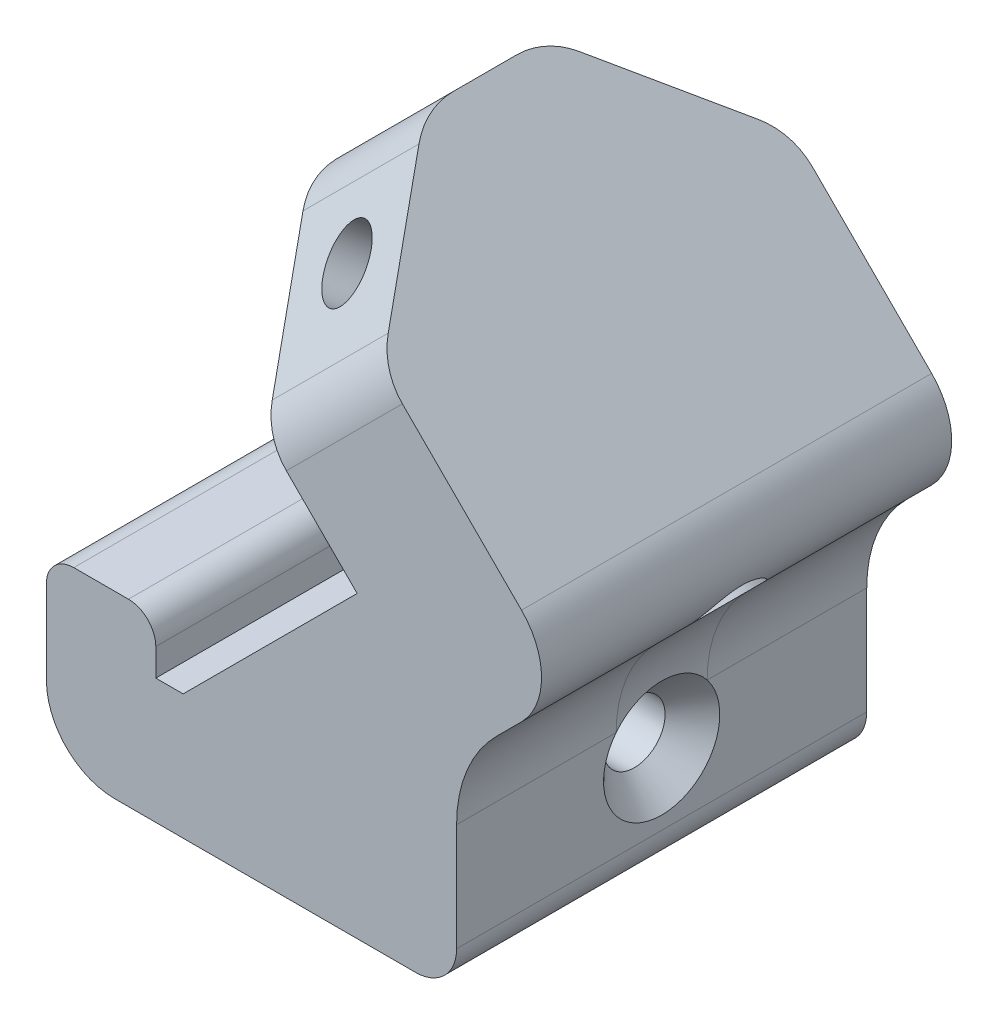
ISO-10303-21;
HEADER;
FILE_DESCRIPTION(('STEP AP214'),'2;1');
FILE_NAME('part.step','',(''),(''),'','','');
FILE_SCHEMA(('AUTOMOTIVE_DESIGN { 1 0 10303 214 1 1 1 1 }'));
ENDSEC;
DATA;
#1=APPLICATION_CONTEXT('core data for automotive mechanical design processes');
#2=APPLICATION_PROTOCOL_DEFINITION('international standard','automotive_design',2000,#1);
#3=PRODUCT_CONTEXT('',#1,'mechanical');
#4=PRODUCT('Part','Part','',(#3));
#5=PRODUCT_RELATED_PRODUCT_CATEGORY('part','',(#4));
#6=PRODUCT_DEFINITION_FORMATION('','',#4);
#7=PRODUCT_DEFINITION_CONTEXT('part definition',#1,'design');
#8=PRODUCT_DEFINITION('design','',#6,#7);
#9=PRODUCT_DEFINITION_SHAPE('','',#8);
#10=(LENGTH_UNIT() NAMED_UNIT(*) SI_UNIT(.MILLI.,.METRE.));
#11=(NAMED_UNIT(*) PLANE_ANGLE_UNIT() SI_UNIT($,.RADIAN.));
#12=(NAMED_UNIT(*) SI_UNIT($,.STERADIAN.) SOLID_ANGLE_UNIT());
#13=UNCERTAINTY_MEASURE_WITH_UNIT(LENGTH_MEASURE(1.E-05),#10,'distance_accuracy_value','');
#14=(GEOMETRIC_REPRESENTATION_CONTEXT(3) GLOBAL_UNCERTAINTY_ASSIGNED_CONTEXT((#13)) GLOBAL_UNIT_ASSIGNED_CONTEXT((#10,
#11,#12)) REPRESENTATION_CONTEXT('',''));
#15=CARTESIAN_POINT('',(0.,0.,0.));
#16=DIRECTION('',(0.,0.,1.));
#17=DIRECTION('',(1.,0.,0.));
#18=AXIS2_PLACEMENT_3D('',#15,#16,#17);
#19=CARTESIAN_POINT('',(12.9289321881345,-29.4974746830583,30.));
#20=DIRECTION('',(-0.707106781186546,0.707106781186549,0.));
#21=DIRECTION('',(-0.707106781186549,-0.707106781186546,0.));
#22=AXIS2_PLACEMENT_3D('',#19,#20,#21);
#23=PLANE('',#22);
#24=DIRECTION('',(0.707106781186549,0.707106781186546,0.));
#25=VECTOR('',#24,1.);
#26=CARTESIAN_POINT('',(12.9289321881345,-29.4974746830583,0.));
#27=LINE('',#26,#25);
#28=CARTESIAN_POINT('',(15.857864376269,-26.5685424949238,0.));
#29=VERTEX_POINT('',#28);
#30=CARTESIAN_POINT('',(17.6776695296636,-24.7487373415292,0.));
#31=VERTEX_POINT('',#30);
#32=EDGE_CURVE('E382',#29,#31,#27,.T.);
#33=ORIENTED_EDGE('',*,*,#32,.T.);
#34=DIRECTION('',(0.,0.,-1.));
#35=VECTOR('',#34,1.);
#36=CARTESIAN_POINT('',(17.6776695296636,-24.7487373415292,30.));
#37=LINE('',#36,#35);
#38=CARTESIAN_POINT('',(17.6776695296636,-24.7487373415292,12.1715728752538));
#39=VERTEX_POINT('',#38);
#40=EDGE_CURVE('E492',#31,#39,#37,.F.);
#41=ORIENTED_EDGE('',*,*,#40,.T.);
#42=CARTESIAN_POINT('',(16.9705627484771,-25.4558441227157,15.));
#43=DIRECTION('',(0.707106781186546,-0.707106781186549,0.));
#44=DIRECTION('',(0.707106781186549,0.707106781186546,0.));
#45=AXIS2_PLACEMENT_3D('',#42,#43,#44);
#46=CIRCLE('',#45,3.);
#47=CARTESIAN_POINT('',(15.8399574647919,-26.5864494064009,12.4616022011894));
#48=VERTEX_POINT('',#47);
#49=EDGE_CURVE('E334',#48,#39,#46,.T.);
#50=ORIENTED_EDGE('',*,*,#49,.F.);
#51=CARTESIAN_POINT('',(15.667926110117,-26.7584807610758,20.682828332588));
#52=CARTESIAN_POINT('',(12.4413043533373,-29.9851025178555,19.596458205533));
#53=CARTESIAN_POINT('',(12.9289321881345,-34.5983685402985,18.901928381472));
#54=CARTESIAN_POINT('',(15.6841761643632,-26.7422307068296,20.5863030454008));
#55=CARTESIAN_POINT('',(12.4625166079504,-29.9638902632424,19.5515867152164));
#56=CARTESIAN_POINT('',(12.9289321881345,-34.5648452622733,18.8874520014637));
#57=CARTESIAN_POINT('',(15.6993633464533,-26.7270435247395,20.4894269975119));
#58=CARTESIAN_POINT('',(12.4835828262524,-29.9428240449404,19.5058843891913));
#59=CARTESIAN_POINT('',(12.9289321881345,-34.530704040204,18.8722057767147));
#60=CARTESIAN_POINT('',(15.7276177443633,-26.6987891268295,20.295061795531));
#61=CARTESIAN_POINT('',(12.5254291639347,-29.9009777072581,19.4127493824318));
#62=CARTESIAN_POINT('',(12.9289321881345,-34.4610471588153,18.8399266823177));
#63=CARTESIAN_POINT('',(15.7406850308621,-26.6857218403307,20.1975726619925));
#64=CARTESIAN_POINT('',(12.5462085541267,-29.8801983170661,19.3653219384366));
#65=CARTESIAN_POINT('',(12.9289321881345,-34.4255315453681,18.8228938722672));
#66=CARTESIAN_POINT('',(15.7767523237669,-26.6496545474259,19.9040229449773));
#67=CARTESIAN_POINT('',(12.6081837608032,-29.8182231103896,19.2202296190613));
#68=CARTESIAN_POINT('',(12.9289321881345,-34.3166059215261,18.7686909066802));
#69=CARTESIAN_POINT('',(15.7965703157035,-26.6298365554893,19.7071625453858));
#70=CARTESIAN_POINT('',(12.649045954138,-29.7773609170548,19.1196947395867));
#71=CARTESIAN_POINT('',(12.9289321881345,-34.2409142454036,18.7284570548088));
#72=CARTESIAN_POINT('',(15.8277842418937,-26.5986226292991,19.3134280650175));
#73=CARTESIAN_POINT('',(12.7298499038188,-29.6965569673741,18.9104555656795));
#74=CARTESIAN_POINT('',(12.9289321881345,-34.0827047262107,18.6373330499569));
#75=CARTESIAN_POINT('',(15.8392340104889,-26.5871728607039,19.1165623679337));
#76=CARTESIAN_POINT('',(12.7697855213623,-29.6566213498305,18.8018702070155));
#77=CARTESIAN_POINT('',(12.9289321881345,-34.000234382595,18.5865137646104));
#78=CARTESIAN_POINT('',(15.8542700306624,-26.5721368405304,18.7224719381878));
#79=CARTESIAN_POINT('',(12.8494001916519,-29.577006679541,18.5739261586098));
#80=CARTESIAN_POINT('',(12.9289321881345,-33.8267095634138,18.4699952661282));
#81=CARTESIAN_POINT('',(15.8578654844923,-26.5685413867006,18.5252478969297));
#82=CARTESIAN_POINT('',(12.88906646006,-29.5373404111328,18.4546591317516));
#83=CARTESIAN_POINT('',(12.9289321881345,-33.7356652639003,18.4043135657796));
#84=CARTESIAN_POINT('',(15.8578633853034,-26.5685434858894,18.1516893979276));
#85=CARTESIAN_POINT('',(12.9644457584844,-29.4619611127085,18.2152352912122));
#86=CARTESIAN_POINT('',(12.9289321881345,-33.553718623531,18.2598280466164));
#87=CARTESIAN_POINT('',(15.8549866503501,-26.5714202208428,17.9753526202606));
#88=CARTESIAN_POINT('',(13.0001063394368,-29.426300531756,18.0966327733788));
#89=CARTESIAN_POINT('',(12.9289321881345,-33.463820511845,18.1831479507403));
#90=CARTESIAN_POINT('',(15.8469536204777,-26.5794532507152,17.7110929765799));
#91=CARTESIAN_POINT('',(13.053906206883,-29.3725006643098,17.9073338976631));
#92=CARTESIAN_POINT('',(12.9289321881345,-33.3227343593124,18.0503054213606));
#93=CARTESIAN_POINT('',(15.8436562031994,-26.5827506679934,17.6230458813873));
#94=CARTESIAN_POINT('',(13.0718630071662,-29.3545438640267,17.8424432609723));
#95=CARTESIAN_POINT('',(12.9289321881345,-33.2746649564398,18.0030532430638));
#96=CARTESIAN_POINT('',(15.8359664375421,-26.5904404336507,17.4470471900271));
#97=CARTESIAN_POINT('',(13.1078368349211,-29.3185700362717,17.7083411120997));
#98=CARTESIAN_POINT('',(12.9289321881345,-33.176563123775,17.9014703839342));
#99=CARTESIAN_POINT('',(15.8315740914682,-26.5948327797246,17.359095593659));
#100=CARTESIAN_POINT('',(13.1258524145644,-29.3005544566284,17.6391431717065));
#101=CARTESIAN_POINT('',(12.9289321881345,-33.1265306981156,17.8471397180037));
#102=CARTESIAN_POINT('',(15.8218649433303,-26.6045419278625,17.1832045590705));
#103=CARTESIAN_POINT('',(13.161892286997,-29.2645145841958,17.4956941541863));
#104=CARTESIAN_POINT('',(12.9289321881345,-33.0247281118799,17.7300565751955));
#105=CARTESIAN_POINT('',(15.8165471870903,-26.6098596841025,17.0952652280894));
#106=CARTESIAN_POINT('',(13.1799155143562,-29.2464913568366,17.4214524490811));
#107=CARTESIAN_POINT('',(12.9289321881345,-32.9729562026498,17.6672954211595));
#108=CARTESIAN_POINT('',(15.805214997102,-26.6211918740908,16.9194775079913));
#109=CARTESIAN_POINT('',(13.2158018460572,-29.2106050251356,17.2672339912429));
#110=CARTESIAN_POINT('',(12.9289321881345,-32.8682847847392,17.5319192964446));
#111=CARTESIAN_POINT('',(15.7992005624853,-26.6272063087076,16.8316291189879));
#112=CARTESIAN_POINT('',(13.2336645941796,-29.1927422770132,17.1872722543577));
#113=CARTESIAN_POINT('',(12.9289321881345,-32.8153852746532,17.4593043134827));
#114=CARTESIAN_POINT('',(15.7867539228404,-26.6396529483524,16.6559559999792));
#115=CARTESIAN_POINT('',(13.2689712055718,-29.157435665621,17.0208003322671));
#116=CARTESIAN_POINT('',(12.9289321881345,-32.709407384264,17.3026086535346));
#117=CARTESIAN_POINT('',(15.7803215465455,-26.6460853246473,16.5681312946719));
#118=CARTESIAN_POINT('',(13.2864158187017,-29.1399910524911,16.9343011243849));
#119=CARTESIAN_POINT('',(12.9289321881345,-32.6563289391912,17.2185232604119));
#120=CARTESIAN_POINT('',(15.7673897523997,-26.6590171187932,16.3924912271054));
#121=CARTESIAN_POINT('',(13.3204519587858,-29.105954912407,16.7540609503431));
#122=CARTESIAN_POINT('',(12.9289321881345,-32.5515580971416,17.0373888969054));
#123=CARTESIAN_POINT('',(15.760890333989,-26.6655165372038,16.3046758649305));
#124=CARTESIAN_POINT('',(13.3370462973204,-29.0893605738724,16.6603294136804));
#125=CARTESIAN_POINT('',(12.9289321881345,-32.49986571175,16.9403398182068));
#126=CARTESIAN_POINT('',(15.7481697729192,-26.6782370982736,16.127979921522));
#127=CARTESIAN_POINT('',(13.3689384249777,-29.0574684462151,16.4640120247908));
#128=CARTESIAN_POINT('',(12.9289321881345,-32.3995532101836,16.7309466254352));
#129=CARTESIAN_POINT('',(15.741952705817,-26.6844541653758,16.0390987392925));
#130=CARTESIAN_POINT('',(13.3842248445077,-29.0421820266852,16.3613348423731));
#131=CARTESIAN_POINT('',(12.9289321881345,-32.350975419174,16.6184389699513));
#132=CARTESIAN_POINT('',(15.7303709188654,-26.6960359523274,15.8612221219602));
#133=CARTESIAN_POINT('',(13.4124209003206,-29.0139859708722,16.1480886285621));
#134=CARTESIAN_POINT('',(12.9289321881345,-32.26067971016,16.3787907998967));
#135=CARTESIAN_POINT('',(15.725006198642,-26.7014006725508,15.7722266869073));
#136=CARTESIAN_POINT('',(13.4253385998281,-29.0010682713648,16.0375043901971));
#137=CARTESIAN_POINT('',(12.9289321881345,-32.2189617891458,16.2516502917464));
#138=CARTESIAN_POINT('',(15.7156442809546,-26.7107625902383,15.5941720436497));
#139=CARTESIAN_POINT('',(13.4477789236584,-28.9786279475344,15.8094488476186));
#140=CARTESIAN_POINT('',(12.9289321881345,-32.1460895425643,15.9843247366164));
#141=CARTESIAN_POINT('',(15.7116457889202,-26.7147610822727,15.5051129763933));
#142=CARTESIAN_POINT('',(13.4573141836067,-28.9690926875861,15.6919471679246));
#143=CARTESIAN_POINT('',(12.9289321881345,-32.114925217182,15.8441521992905));
#144=CARTESIAN_POINT('',(15.7054540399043,-26.7209528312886,15.326868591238));
#145=CARTESIAN_POINT('',(13.4720538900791,-28.9543529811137,15.4519968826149));
#146=CARTESIAN_POINT('',(12.9289321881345,-32.0665970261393,15.5543438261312));
#147=CARTESIAN_POINT('',(15.7032606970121,-26.7231461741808,15.2376832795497));
#148=CARTESIAN_POINT('',(13.4772666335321,-28.9491402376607,15.3294877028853));
#149=CARTESIAN_POINT('',(12.9289321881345,-32.0494324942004,15.4047084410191));
#150=CARTESIAN_POINT('',(15.7009500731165,-26.7254567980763,15.0591965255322));
#151=CARTESIAN_POINT('',(13.48275445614,-28.9436524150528,15.0825095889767));
#152=CARTESIAN_POINT('',(12.9289321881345,-32.0313482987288,15.1016279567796));
#153=CARTESIAN_POINT('',(15.7008341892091,-26.7255726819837,14.9698950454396));
#154=CARTESIAN_POINT('',(13.4830296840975,-28.9433771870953,14.957961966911));
#155=CARTESIAN_POINT('',(12.9289321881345,-32.0304395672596,14.9481803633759));
#156=CARTESIAN_POINT('',(15.7026971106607,-26.7237097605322,14.7913357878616));
#157=CARTESIAN_POINT('',(13.4786055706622,-28.9478013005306,14.7105228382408));
#158=CARTESIAN_POINT('',(12.9289321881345,-32.0450223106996,14.6442815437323));
#159=CARTESIAN_POINT('',(15.7046759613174,-26.7217309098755,14.7020780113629));
#160=CARTESIAN_POINT('',(13.4739033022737,-28.9525035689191,14.5875529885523));
#161=CARTESIAN_POINT('',(12.9289321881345,-32.0605141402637,14.4938303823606));
#162=CARTESIAN_POINT('',(15.7104833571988,-26.715923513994,14.5236059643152));
#163=CARTESIAN_POINT('',(13.4600843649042,-28.9663225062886,14.3463015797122));
#164=CARTESIAN_POINT('',(12.9289321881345,-32.1058581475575,14.2017454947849));
#165=CARTESIAN_POINT('',(15.7143135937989,-26.7120932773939,14.4343918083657));
#166=CARTESIAN_POINT('',(13.4509558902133,-28.9754509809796,14.2279611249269));
#167=CARTESIAN_POINT('',(12.9289321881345,-32.1357234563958,14.0601199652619));
#168=CARTESIAN_POINT('',(15.7233916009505,-26.7030152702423,14.2561102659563));
#169=CARTESIAN_POINT('',(13.4292187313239,-28.9971881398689,13.9981950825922));
#170=CARTESIAN_POINT('',(12.9289321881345,-32.2063995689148,13.7897625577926));
#171=CARTESIAN_POINT('',(15.7286394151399,-26.6977674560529,14.1670428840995));
#172=CARTESIAN_POINT('',(13.4166004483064,-29.0098064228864,13.8867297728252));
#173=CARTESIAN_POINT('',(12.9289321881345,-32.2472107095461,13.6610310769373));
#174=CARTESIAN_POINT('',(15.7414094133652,-26.6849974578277,13.9676748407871));
#175=CARTESIAN_POINT('',(13.3855752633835,-29.0408316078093,13.6458662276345));
#176=CARTESIAN_POINT('',(12.9289321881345,-32.3467108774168,13.3890619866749));
#177=CARTESIAN_POINT('',(15.7491751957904,-26.6772316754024,13.8574063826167));
#178=CARTESIAN_POINT('',(13.366499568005,-29.0599073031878,13.5186140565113));
#179=CARTESIAN_POINT('',(12.9289321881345,-32.4073400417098,13.2497532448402));
#180=CARTESIAN_POINT('',(15.7651593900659,-26.6612474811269,13.6369372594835));
#181=CARTESIAN_POINT('',(13.326208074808,-29.1001987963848,13.2762563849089));
#182=CARTESIAN_POINT('',(12.9289321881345,-32.5337249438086,12.9932335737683));
#183=CARTESIAN_POINT('',(15.7733778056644,-26.6530290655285,13.5267365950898));
#184=CARTESIAN_POINT('',(13.3049826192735,-29.1214242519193,13.1611556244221));
#185=CARTESIAN_POINT('',(12.9289321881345,-32.5994807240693,12.8760228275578));
#186=CARTESIAN_POINT('',(15.789472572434,-26.6369342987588,13.3063252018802));
#187=CARTESIAN_POINT('',(13.261515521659,-29.1648913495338,12.9419491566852));
#188=CARTESIAN_POINT('',(12.9289321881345,-32.7320252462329,12.6611716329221));
#189=CARTESIAN_POINT('',(15.7973490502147,-26.6290578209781,13.1961144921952));
#190=CARTESIAN_POINT('',(13.2392703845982,-29.1871364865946,12.8378624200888));
#191=CARTESIAN_POINT('',(12.9289321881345,-32.7988135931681,12.5635238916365));
#192=CARTESIAN_POINT('',(15.8121454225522,-26.6142614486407,12.97556363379));
#193=CARTESIAN_POINT('',(13.1944148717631,-29.2319919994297,12.6391044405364));
#194=CARTESIAN_POINT('',(12.9289321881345,-32.9310319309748,12.3846171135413));
#195=CARTESIAN_POINT('',(15.8190653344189,-26.607341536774,12.8652234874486));
#196=CARTESIAN_POINT('',(13.1718045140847,-29.2546023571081,12.5444624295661));
#197=CARTESIAN_POINT('',(12.9289321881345,-32.9964619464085,12.3033577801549));
#198=CARTESIAN_POINT('',(15.8314661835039,-26.594940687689,12.6446604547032));
#199=CARTESIAN_POINT('',(13.1266111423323,-29.2997957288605,12.3633218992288));
#200=CARTESIAN_POINT('',(12.9289321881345,-33.1245435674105,12.1544325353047));
#201=CARTESIAN_POINT('',(15.8369507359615,-26.5894561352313,12.5344379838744));
#202=CARTESIAN_POINT('',(13.1040301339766,-29.3223767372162,12.2768317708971));
#203=CARTESIAN_POINT('',(12.9289321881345,-33.1872018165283,12.0867325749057));
#204=CARTESIAN_POINT('',(15.8461587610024,-26.5802481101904,12.3138428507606));
#205=CARTESIAN_POINT('',(13.0589712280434,-29.3674356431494,12.1104267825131));
#206=CARTESIAN_POINT('',(12.9289321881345,-33.3093789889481,11.9621366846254));
#207=CARTESIAN_POINT('',(15.849882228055,-26.5765246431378,12.203470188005));
#208=CARTESIAN_POINT('',(13.036496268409,-29.3899106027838,12.0305382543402));
#209=CARTESIAN_POINT('',(12.9289321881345,-33.3688979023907,11.9052407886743));
#210=CARTESIAN_POINT('',(15.8553116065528,-26.5710952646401,11.9826043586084));
#211=CARTESIAN_POINT('',(12.991664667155,-29.4347422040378,11.8762501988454));
#212=CARTESIAN_POINT('',(12.9289321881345,-33.4846772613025,11.8001754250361));
#213=CARTESIAN_POINT('',(15.8570172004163,-26.5693896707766,11.8721111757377));
#214=CARTESIAN_POINT('',(12.9693111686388,-29.457095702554,11.8018743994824));
#215=CARTESIAN_POINT('',(12.9289321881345,-33.5409371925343,11.7520073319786));
#216=CARTESIAN_POINT('',(15.8582218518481,-26.5681850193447,11.6511005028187));
#217=CARTESIAN_POINT('',(12.9246852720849,-29.5017215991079,11.6577739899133));
#218=CARTESIAN_POINT('',(12.9289321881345,-33.6502800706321,11.6627757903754));
#219=CARTESIAN_POINT('',(15.8577208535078,-26.568686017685,11.5405830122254));
#220=CARTESIAN_POINT('',(12.9024158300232,-29.5239910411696,11.5880689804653));
#221=CARTESIAN_POINT('',(12.9289321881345,-33.7033629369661,11.6217125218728));
#222=CARTESIAN_POINT('',(15.8526967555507,-26.5737101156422,11.2097909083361));
#223=CARTESIAN_POINT('',(12.8356860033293,-29.5907208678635,11.3850521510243));
#224=CARTESIAN_POINT('',(12.9289321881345,-33.8578324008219,11.5073858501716));
#225=CARTESIAN_POINT('',(15.8446712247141,-26.5817356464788,10.9895936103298));
#226=CARTESIAN_POINT('',(12.7913245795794,-29.6350822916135,11.2579020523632));
#227=CARTESIAN_POINT('',(12.9289321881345,-33.9547952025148,11.4426787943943));
#228=CARTESIAN_POINT('',(15.8185597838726,-26.6078470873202,10.5504198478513));
#229=CARTESIAN_POINT('',(12.7020228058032,-29.7243840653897,11.0154271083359));
#230=CARTESIAN_POINT('',(12.9289321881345,-34.1388331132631,11.3288568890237));
#231=CARTESIAN_POINT('',(15.8004748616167,-26.6259320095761,10.3314432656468));
#232=CARTESIAN_POINT('',(12.657097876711,-29.7693089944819,10.9001949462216));
#233=CARTESIAN_POINT('',(12.9289321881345,-34.2259091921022,11.2797405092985));
#234=CARTESIAN_POINT('',(15.7533508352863,-26.6730560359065,9.89035637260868));
#235=CARTESIAN_POINT('',(12.5650045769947,-29.8614022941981,10.6765494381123));
#236=CARTESIAN_POINT('',(12.9289321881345,-34.3941184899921,11.1915290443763));
#237=CARTESIAN_POINT('',(15.7240552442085,-26.7023516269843,9.66829994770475));
#238=CARTESIAN_POINT('',(12.5178235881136,-29.9085832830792,10.5684546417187));
#239=CARTESIAN_POINT('',(12.9289321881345,-34.4750548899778,11.1527076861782));
#240=CARTESIAN_POINT('',(15.6718639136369,-26.7545429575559,9.33779274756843));
#241=CARTESIAN_POINT('',(12.4459145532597,-29.9804923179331,10.412814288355));
#242=CARTESIAN_POINT('',(12.9289321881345,-34.5914257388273,11.1008476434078));
#243=CARTESIAN_POINT('',(15.6530837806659,-26.7733230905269,9.22801364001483));
#244=CARTESIAN_POINT('',(12.4217177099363,-30.0046891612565,10.3619462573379));
#245=CARTESIAN_POINT('',(12.9289321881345,-34.6293900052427,11.0846182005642));
#246=CARTESIAN_POINT('',(15.6127798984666,-26.8136269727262,9.0094641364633));
#247=CARTESIAN_POINT('',(12.3728920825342,-30.0535147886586,10.2622303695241));
#248=CARTESIAN_POINT('',(12.9289321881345,-34.7038040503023,11.0540210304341));
#249=CARTESIAN_POINT('',(15.5912560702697,-26.8351508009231,8.90069376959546));
#250=CARTESIAN_POINT('',(12.3482640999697,-30.0781427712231,10.2133889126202));
#251=CARTESIAN_POINT('',(12.9289321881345,-34.7402537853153,11.0396533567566));
#252=CARTESIAN_POINT('',(15.5683636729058,-26.858043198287,8.79249165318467));
#253=CARTESIAN_POINT('',(12.3234201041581,-30.1029867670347,10.165530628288));
#254=CARTESIAN_POINT('',(12.9289321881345,-34.7760328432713,11.0260822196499));
#255=(BOUNDED_SURFACE() B_SPLINE_SURFACE(3,2,((#51,#52,#53),(#54,#55,#56),(#57,#58,#59),(#60,
#61,#62),(#63,#64,#65),(#66,#67,#68),(#69,#70,#71),(#72,#73,#74),(#75,#76,#77),(#78,#79,#80),
(#81,#82,#83),(#84,#85,#86),(#87,#88,#89),(#90,#91,#92),(#93,#94,#95),(#96,#97,#98),(#99,#100,
#101),(#102,#103,#104),(#105,#106,#107),(#108,#109,#110),(#111,#112,#113),(#114,#115,#116),
(#117,#118,#119),(#120,#121,#122),(#123,#124,#125),(#126,#127,#128),(#129,#130,#131),(#132,#133,
#134),(#135,#136,#137),(#138,#139,#140),(#141,#142,#143),(#144,#145,#146),(#147,#148,#149),
(#150,#151,#152),(#153,#154,#155),(#156,#157,#158),(#159,#160,#161),(#162,#163,#164),(#165,#166,
#167),(#168,#169,#170),(#171,#172,#173),(#174,#175,#176),(#177,#178,#179),(#180,#181,#182),
(#183,#184,#185),(#186,#187,#188),(#189,#190,#191),(#192,#193,#194),(#195,#196,#197),(#198,#199,
#200),(#201,#202,#203),(#204,#205,#206),(#207,#208,#209),(#210,#211,#212),(#213,#214,#215),
(#216,#217,#218),(#219,#220,#221),(#222,#223,#224),(#225,#226,#227),(#228,#229,#230),(#231,#232,
#233),(#234,#235,#236),(#237,#238,#239),(#240,#241,#242),(#243,#244,#245),(#246,#247,#248),
(#249,#250,#251),(#252,#253,#254)),.UNSPECIFIED.,.F.,.F.,.F.) B_SPLINE_SURFACE_WITH_KNOTS((4,2,
2,2,2,2,2,2,2,2,2,2,2,2,2,2,2,2,2,2,2,2,2,2,2,2,2,2,2,2,2,2,2,4),(3,3),(0.,0.297644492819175,
0.595279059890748,1.19141778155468,1.78368683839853,2.37526160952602,2.90424370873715,
3.16874358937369,3.43324291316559,3.6980165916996,3.9627906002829,4.22767380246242,
4.4925592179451,4.76050061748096,5.02844189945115,5.29612858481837,5.56380252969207,
5.8316564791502,6.09951622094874,6.36762113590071,6.63573430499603,6.96816857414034,
7.30060559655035,7.63291845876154,7.96522530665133,8.29668693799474,8.62814961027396,
8.95966444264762,9.29118767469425,9.95218660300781,10.613120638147,11.2901796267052,
11.6289566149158,11.9677433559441),(0.,1.),
.UNSPECIFIED.) GEOMETRIC_REPRESENTATION_ITEM() RATIONAL_B_SPLINE_SURFACE(((1.,0.905348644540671,
1.),(1.,0.90600321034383,1.),(1.,0.90666913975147,1.),(1.,0.908026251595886,1.),(1.,
0.908717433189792,1.),(1.,0.91083477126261,1.),(1.,0.912302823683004,1.),(1.,0.915363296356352,
1.),(1.,0.916954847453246,1.),(1.,0.920294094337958,1.),(1.,0.922041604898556,1.),(1.,
0.925522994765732,1.),(1.,0.927238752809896,1.),(1.,0.929923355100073,1.),(1.,0.930836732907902,
1.),(1.,0.93269793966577,1.),(1.,0.933645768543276,1.),(1.,0.935571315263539,1.),(1.,
0.936549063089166,1.),(1.,0.938522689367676,1.),(1.,0.939518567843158,1.),(1.,0.941510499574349,
1.),(1.,0.942506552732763,1.),(1.,0.944469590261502,1.),(1.,0.945436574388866,1.),(1.,
0.947310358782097,1.),(1.,0.94821633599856,1.),(1.,0.949898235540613,1.),(1.,0.950674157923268,
1.),(1.,0.952028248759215,1.),(1.,0.952606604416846,1.),(1.,0.953503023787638,1.),(1.,
0.953821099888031,1.),(1.,0.954156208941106,1.),(1.,0.954173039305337,1.),(1.,0.953902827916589,
1.),(1.,0.95361577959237,1.),(1.,0.952774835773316,1.),(1.,0.952220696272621,1.),(1.,
0.950907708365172,1.),(1.,0.950148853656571,1.),(1.,0.948296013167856,1.),(1.,0.947165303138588,
1.),(1.,0.944803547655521,1.),(1.,0.943572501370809,1.),(1.,0.941086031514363,1.),(1.,
0.939830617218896,1.),(1.,0.937340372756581,1.),(1.,0.936105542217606,1.),(1.,0.933683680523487,
1.),(1.,0.932496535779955,1.),(1.,0.930177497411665,1.),(1.,0.929045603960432,1.),(1.,
0.926839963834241,1.),(1.,0.925766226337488,1.),(1.,0.92367594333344,1.),(1.,0.922659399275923,
1.),(1.,0.919696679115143,1.),(1.,0.917830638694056,1.),(1.,0.914279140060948,1.),(1.,
0.912593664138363,1.),(1.,0.909329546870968,1.),(1.,0.907754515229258,1.),(1.,0.905484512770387,
1.),(1.,0.904743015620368,1.),(1.,0.90328787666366,1.),(1.,0.902574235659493,1.),(1.,
0.901872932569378,1.))) REPRESENTATION_ITEM('') SURFACE());
#256=CARTESIAN_POINT('',(15.667926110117,-26.7584807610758,20.682828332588));
#257=CARTESIAN_POINT('',(15.6841761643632,-26.7422307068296,20.5863030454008));
#258=CARTESIAN_POINT('',(15.6993633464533,-26.7270435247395,20.4894269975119));
#259=CARTESIAN_POINT('',(15.7276177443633,-26.6987891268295,20.295061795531));
#260=CARTESIAN_POINT('',(15.7406850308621,-26.6857218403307,20.1975726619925));
#261=CARTESIAN_POINT('',(15.7767523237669,-26.6496545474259,19.9040229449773));
#262=CARTESIAN_POINT('',(15.7965703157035,-26.6298365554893,19.7071625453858));
#263=CARTESIAN_POINT('',(15.8277842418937,-26.5986226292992,19.3134280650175));
#264=CARTESIAN_POINT('',(15.8392340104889,-26.5871728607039,19.1165623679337));
#265=CARTESIAN_POINT('',(15.8542700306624,-26.5721368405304,18.7224719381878));
#266=CARTESIAN_POINT('',(15.8578654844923,-26.5685413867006,18.5252478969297));
#267=CARTESIAN_POINT('',(15.8578633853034,-26.5685434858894,18.1516893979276));
#268=CARTESIAN_POINT('',(15.8549866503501,-26.5714202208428,17.9753526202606));
#269=CARTESIAN_POINT('',(15.8469536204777,-26.5794532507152,17.7110929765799));
#270=CARTESIAN_POINT('',(15.8436562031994,-26.5827506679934,17.6230458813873));
#271=CARTESIAN_POINT('',(15.8359664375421,-26.5904404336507,17.4470471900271));
#272=CARTESIAN_POINT('',(15.8315740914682,-26.5948327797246,17.359095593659));
#273=CARTESIAN_POINT('',(15.8218649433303,-26.6045419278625,17.1832045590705));
#274=CARTESIAN_POINT('',(15.8165471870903,-26.6098596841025,17.0952652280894));
#275=CARTESIAN_POINT('',(15.805214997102,-26.6211918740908,16.9194775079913));
#276=CARTESIAN_POINT('',(15.7992005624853,-26.6272063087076,16.8316291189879));
#277=CARTESIAN_POINT('',(15.7867539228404,-26.6396529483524,16.6559559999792));
#278=CARTESIAN_POINT('',(15.7803215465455,-26.6460853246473,16.5681312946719));
#279=CARTESIAN_POINT('',(15.7673897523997,-26.6590171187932,16.3924912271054));
#280=CARTESIAN_POINT('',(15.760890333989,-26.6655165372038,16.3046758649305));
#281=CARTESIAN_POINT('',(15.7481697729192,-26.6782370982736,16.127979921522));
#282=CARTESIAN_POINT('',(15.741952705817,-26.6844541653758,16.0390987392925));
#283=CARTESIAN_POINT('',(15.7303709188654,-26.6960359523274,15.8612221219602));
#284=CARTESIAN_POINT('',(15.725006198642,-26.7014006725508,15.7722266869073));
#285=CARTESIAN_POINT('',(15.7156442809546,-26.7107625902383,15.5941720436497));
#286=CARTESIAN_POINT('',(15.7116457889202,-26.7147610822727,15.5051129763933));
#287=CARTESIAN_POINT('',(15.7054540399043,-26.7209528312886,15.326868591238));
#288=CARTESIAN_POINT('',(15.7032606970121,-26.7231461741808,15.2376832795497));
#289=CARTESIAN_POINT('',(15.7009500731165,-26.7254567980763,15.0591965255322));
#290=CARTESIAN_POINT('',(15.7008341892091,-26.7255726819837,14.9698950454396));
#291=CARTESIAN_POINT('',(15.7026971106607,-26.7237097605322,14.7913357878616));
#292=CARTESIAN_POINT('',(15.7046759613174,-26.7217309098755,14.7020780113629));
#293=CARTESIAN_POINT('',(15.7104833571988,-26.715923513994,14.5236059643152));
#294=CARTESIAN_POINT('',(15.7143135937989,-26.7120932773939,14.4343918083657));
#295=CARTESIAN_POINT('',(15.7233916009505,-26.7030152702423,14.2561102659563));
#296=CARTESIAN_POINT('',(15.7286394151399,-26.6977674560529,14.1670428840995));
#297=CARTESIAN_POINT('',(15.7414094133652,-26.6849974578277,13.9676748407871));
#298=CARTESIAN_POINT('',(15.7491751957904,-26.6772316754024,13.8574063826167));
#299=CARTESIAN_POINT('',(15.7651593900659,-26.6612474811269,13.6369372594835));
#300=CARTESIAN_POINT('',(15.7733778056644,-26.6530290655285,13.5267365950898));
#301=CARTESIAN_POINT('',(15.789472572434,-26.6369342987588,13.3063252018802));
#302=CARTESIAN_POINT('',(15.7973490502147,-26.6290578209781,13.1961144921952));
#303=CARTESIAN_POINT('',(15.8121454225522,-26.6142614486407,12.97556363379));
#304=CARTESIAN_POINT('',(15.8190653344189,-26.607341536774,12.8652234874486));
#305=CARTESIAN_POINT('',(15.8314661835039,-26.594940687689,12.6446604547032));
#306=CARTESIAN_POINT('',(15.8369507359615,-26.5894561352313,12.5344379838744));
#307=CARTESIAN_POINT('',(15.8461587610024,-26.5802481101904,12.3138428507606));
#308=CARTESIAN_POINT('',(15.849882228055,-26.5765246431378,12.203470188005));
#309=CARTESIAN_POINT('',(15.8553116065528,-26.5710952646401,11.9826043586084));
#310=CARTESIAN_POINT('',(15.8570172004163,-26.5693896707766,11.8721111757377));
#311=CARTESIAN_POINT('',(15.8582218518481,-26.5681850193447,11.6511005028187));
#312=CARTESIAN_POINT('',(15.8577208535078,-26.568686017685,11.5405830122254));
#313=CARTESIAN_POINT('',(15.8526967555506,-26.5737101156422,11.2097909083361));
#314=CARTESIAN_POINT('',(15.8446712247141,-26.5817356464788,10.9895936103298));
#315=CARTESIAN_POINT('',(15.8185597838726,-26.6078470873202,10.5504198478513));
#316=CARTESIAN_POINT('',(15.8004748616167,-26.6259320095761,10.3314432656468));
#317=CARTESIAN_POINT('',(15.7533508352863,-26.6730560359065,9.89035637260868));
#318=CARTESIAN_POINT('',(15.7240552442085,-26.7023516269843,9.66829994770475));
#319=CARTESIAN_POINT('',(15.6718639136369,-26.7545429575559,9.33779274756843));
#320=CARTESIAN_POINT('',(15.6530837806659,-26.7733230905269,9.22801364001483));
#321=CARTESIAN_POINT('',(15.6127798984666,-26.8136269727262,9.0094641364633));
#322=CARTESIAN_POINT('',(15.5912560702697,-26.8351508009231,8.90069376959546));
#323=CARTESIAN_POINT('',(15.5683636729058,-26.858043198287,8.79249165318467));
#324=B_SPLINE_CURVE_WITH_KNOTS('',3,(#256,#257,#258,#259,#260,#261,#262,#263,#264,#265,#266,
#267,#268,#269,#270,#271,#272,#273,#274,#275,#276,#277,#278,#279,#280,#281,#282,#283,#284,#285,
#286,#287,#288,#289,#290,#291,#292,#293,#294,#295,#296,#297,#298,#299,#300,#301,#302,#303,#304,
#305,#306,#307,#308,#309,#310,#311,#312,#313,#314,#315,#316,#317,#318,#319,#320,#321,#322,#323),
.UNSPECIFIED.,.F.,.F.,(4,2,2,2,2,2,2,2,2,2,2,2,2,2,2,2,2,2,2,2,2,2,2,2,2,2,2,2,2,2,2,2,2,4),(0.,
0.297644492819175,0.595279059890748,1.19141778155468,1.78368683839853,2.37526160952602,
2.90424370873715,3.16874358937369,3.43324291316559,3.6980165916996,3.9627906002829,
4.22767380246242,4.4925592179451,4.76050061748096,5.02844189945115,5.29612858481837,
5.56380252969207,5.8316564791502,6.09951622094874,6.36762113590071,6.63573430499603,
6.96816857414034,7.30060559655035,7.63291845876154,7.96522530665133,8.29668693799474,
8.62814961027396,8.95966444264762,9.29118767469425,9.95218660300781,10.613120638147,
11.2901796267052,11.6289566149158,11.9677433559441),.UNSPECIFIED.);
#325=CARTESIAN_POINT('',(15.857864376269,-26.5685424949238,11.6719645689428));
#326=VERTEX_POINT('',#325);
#327=EDGE_CURVE('E1179',#48,#326,#324,.T.);
#328=ORIENTED_EDGE('',*,*,#327,.T.);
#329=DIRECTION('',(0.,0.,-1.));
#330=VECTOR('',#329,1.);
#331=CARTESIAN_POINT('',(15.857864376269,-26.5685424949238,0.));
#332=LINE('',#331,#330);
#333=EDGE_CURVE('E1180',#326,#29,#332,.T.);
#334=ORIENTED_EDGE('',*,*,#333,.T.);
#335=EDGE_LOOP('',(#33,#41,#50,#328,#334));
#336=FACE_BOUND('',#335,.T.);
#337=ADVANCED_FACE('F35',(#336),#23,.F.);
#338=CARTESIAN_POINT('',(4.24264068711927,-12.7279220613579,15.));
#339=DIRECTION('',(0.707106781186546,-0.707106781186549,0.));
#340=DIRECTION('',(0.707106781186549,0.707106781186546,0.));
#341=AXIS2_PLACEMENT_3D('',#338,#339,#340);
#342=PLANE('',#341);
#343=CARTESIAN_POINT('',(4.24264068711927,-12.7279220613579,17.2928932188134));
#344=DIRECTION('',(0.707106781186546,-0.707106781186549,0.));
#345=DIRECTION('',(0.,0.,1.));
#346=AXIS2_PLACEMENT_3D('',#343,#344,#345);
#347=ELLIPSE('',#346,4.2426406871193,3.);
#348=CARTESIAN_POINT('',(2.23043049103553,-14.7401322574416,15.9497474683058));
#349=VERTEX_POINT('',#348);
#350=CARTESIAN_POINT('',(2.45779890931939,-14.5127638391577,15.));
#351=VERTEX_POINT('',#350);
#352=EDGE_CURVE('E655',#349,#351,#347,.T.);
#353=ORIENTED_EDGE('',*,*,#352,.F.);
#354=CARTESIAN_POINT('',(4.24264068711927,-12.7279220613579,15.));
#355=DIRECTION('',(0.707106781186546,-0.707106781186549,0.));
#356=DIRECTION('',(0.707106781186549,0.707106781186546,0.));
#357=AXIS2_PLACEMENT_3D('',#354,#355,#356);
#358=CIRCLE('',#357,3.);
#359=CARTESIAN_POINT('',(2.23043049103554,-14.7401322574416,14.0502525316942));
#360=VERTEX_POINT('',#359);
#361=EDGE_CURVE('E330',#349,#360,#358,.T.);
#362=ORIENTED_EDGE('',*,*,#361,.T.);
#363=CARTESIAN_POINT('',(4.24264068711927,-12.7279220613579,12.7071067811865));
#364=DIRECTION('',(0.707106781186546,-0.707106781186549,0.));
#365=DIRECTION('',(0.,0.,-1.));
#366=AXIS2_PLACEMENT_3D('',#363,#364,#365);
#367=ELLIPSE('',#366,4.24264068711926,3.);
#368=EDGE_CURVE('E673',#360,#351,#367,.F.);
#369=ORIENTED_EDGE('',*,*,#368,.T.);
#370=EDGE_LOOP('',(#353,#362,#369));
#371=FACE_BOUND('',#370,.T.);
#372=ADVANCED_FACE('F461',(#371),#342,.T.);
#373=CARTESIAN_POINT('',(4.24264068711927,-12.7279220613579,15.));
#374=DIRECTION('',(0.707106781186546,-0.707106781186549,0.));
#375=DIRECTION('',(0.707106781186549,0.707106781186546,0.));
#376=AXIS2_PLACEMENT_3D('',#373,#374,#375);
#377=CYLINDRICAL_SURFACE('',#376,3.);
#378=CARTESIAN_POINT('',(5.86396103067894,-14.3492424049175,15.));
#379=DIRECTION('',(0.270598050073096,-0.270598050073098,-0.923879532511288));
#380=DIRECTION('',(-0.653281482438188,0.65328148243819,-0.382683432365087));
#381=AXIS2_PLACEMENT_3D('',#378,#379,#380);
#382=ELLIPSE('',#381,7.83937778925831,3.);
#383=CARTESIAN_POINT('',(7.98528137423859,-12.2279220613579,15.));
#384=VERTEX_POINT('',#383);
#385=CARTESIAN_POINT('',(6.254850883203,-10.7157118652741,14.0502525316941));
#386=VERTEX_POINT('',#385);
#387=EDGE_CURVE('E340',#384,#386,#382,.F.);
#388=ORIENTED_EDGE('',*,*,#387,.F.);
#389=CARTESIAN_POINT('',(5.86396103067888,-14.3492424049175,15.));
#390=DIRECTION('',(0.2705980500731,-0.270598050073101,0.923879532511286));
#391=DIRECTION('',(0.653281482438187,-0.653281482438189,-0.382683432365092));
#392=AXIS2_PLACEMENT_3D('',#389,#390,#391);
#393=ELLIPSE('',#392,7.83937778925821,3.);
#394=CARTESIAN_POINT('',(6.254850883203,-10.7157118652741,15.9497474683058));
#395=VERTEX_POINT('',#394);
#396=EDGE_CURVE('E649',#384,#395,#393,.T.);
#397=ORIENTED_EDGE('',*,*,#396,.T.);
#398=EDGE_CURVE('E326',#386,#395,#358,.T.);
#399=ORIENTED_EDGE('',*,*,#398,.F.);
#400=EDGE_LOOP('',(#388,#397,#399));
#401=FACE_BOUND('',#400,.T.);
#402=ADVANCED_FACE('F468',(#401),#377,.F.);
#403=CARTESIAN_POINT('',(7.25735931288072,-15.7426406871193,16.9705627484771));
#404=DIRECTION('',(-0.500000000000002,0.500000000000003,-0.707106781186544));
#405=DIRECTION('',(0.,0.816496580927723,0.577350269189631));
#406=AXIS2_PLACEMENT_3D('',#403,#404,#405);
#407=PLANE('',#406);
#408=DIRECTION('',(-0.499999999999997,0.499999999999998,0.707106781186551));
#409=VECTOR('',#408,1.);
#410=CARTESIAN_POINT('',(7.86533894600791,-17.9214576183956,15.));
#411=LINE('',#410,#409);
#412=CARTESIAN_POINT('',(5.89477619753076,-15.9508948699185,17.7867965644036));
#413=VERTEX_POINT('',#412);
#414=CARTESIAN_POINT('',(5.07854238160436,-15.1346610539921,18.9411254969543));
#415=VERTEX_POINT('',#414);
#416=EDGE_CURVE('E316',#413,#415,#411,.T.);
#417=ORIENTED_EDGE('',*,*,#416,.F.);
#418=CARTESIAN_POINT('',(8.65075759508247,-17.1360389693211,15.));
#419=DIRECTION('',(-0.500000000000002,0.500000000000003,-0.707106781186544));
#420=DIRECTION('',(0.499999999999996,-0.499999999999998,-0.707106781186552));
#421=AXIS2_PLACEMENT_3D('',#418,#419,#420);
#422=ELLIPSE('',#421,4.24264068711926,3.);
#423=CARTESIAN_POINT('',(5.87652419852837,-18.2778047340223,16.1543289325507));
#424=VERTEX_POINT('',#423);
#425=EDGE_CURVE('E679',#424,#413,#422,.T.);
#426=ORIENTED_EDGE('',*,*,#425,.F.);
#427=CARTESIAN_POINT('',(7.25735931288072,-15.7426406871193,16.9705627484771));
#428=DIRECTION('',(-0.500000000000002,0.500000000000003,-0.707106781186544));
#429=DIRECTION('',(0.,0.816496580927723,0.577350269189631));
#430=AXIS2_PLACEMENT_3D('',#427,#428,#429);
#431=CIRCLE('',#430,3.);
#432=EDGE_CURVE('E344',#424,#415,#431,.T.);
#433=ORIENTED_EDGE('',*,*,#432,.T.);
#434=EDGE_LOOP('',(#417,#426,#433));
#435=FACE_BOUND('',#434,.T.);
#436=ADVANCED_FACE('F515',(#435),#407,.T.);
#437=CARTESIAN_POINT('',(7.25735931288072,-15.7426406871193,16.9705627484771));
#438=DIRECTION('',(-0.500000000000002,0.500000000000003,-0.707106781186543));
#439=DIRECTION('',(0.,0.816496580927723,0.577350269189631));
#440=AXIS2_PLACEMENT_3D('',#437,#438,#439);
#441=CYLINDRICAL_SURFACE('',#440,3.);
#442=CARTESIAN_POINT('',(5.86396103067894,-14.3492424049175,15.));
#443=DIRECTION('',(0.270598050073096,-0.270598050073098,-0.923879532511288));
#444=DIRECTION('',(-0.653281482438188,0.65328148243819,-0.382683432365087));
#445=AXIS2_PLACEMENT_3D('',#442,#443,#444);
#446=ELLIPSE('',#445,7.83937778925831,3.);
#447=CARTESIAN_POINT('',(3.74264068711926,-16.4705627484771,15.));
#448=VERTEX_POINT('',#447);
#449=EDGE_CURVE('E329',#424,#448,#446,.T.);
#450=ORIENTED_EDGE('',*,*,#449,.T.);
#451=CARTESIAN_POINT('',(5.86396103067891,-14.3492424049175,15.));
#452=DIRECTION('',(-0.707106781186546,0.707106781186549,0.));
#453=DIRECTION('',(0.,0.,-1.));
#454=AXIS2_PLACEMENT_3D('',#451,#452,#453);
#455=ELLIPSE('',#454,4.24264068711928,3.);
#456=EDGE_CURVE('E292',#448,#415,#455,.T.);
#457=ORIENTED_EDGE('',*,*,#456,.T.);
#458=ORIENTED_EDGE('',*,*,#432,.F.);
#459=EDGE_LOOP('',(#450,#457,#458));
#460=FACE_BOUND('',#459,.T.);
#461=ADVANCED_FACE('F525',(#460),#441,.F.);
#462=CARTESIAN_POINT('',(21.2132034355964,-21.2132034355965,30.));
#463=DIRECTION('',(-0.707106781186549,-0.707106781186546,0.));
#464=DIRECTION('',(0.707106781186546,-0.707106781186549,0.));
#465=AXIS2_PLACEMENT_3D('',#462,#463,#464);
#466=PLANE('',#465);
#467=DIRECTION('',(-0.707106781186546,0.707106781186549,0.));
#468=VECTOR('',#467,1.);
#469=CARTESIAN_POINT('',(21.2132034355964,-21.2132034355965,30.));
#470=LINE('',#469,#468);
#471=CARTESIAN_POINT('',(17.6776695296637,-17.6776695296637,30.));
#472=VERTEX_POINT('',#471);
#473=CARTESIAN_POINT('',(8.96446609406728,-8.9644660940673,30.));
#474=VERTEX_POINT('',#473);
#475=EDGE_CURVE('E379',#472,#474,#470,.T.);
#476=ORIENTED_EDGE('',*,*,#475,.F.);
#477=DIRECTION('',(0.,0.,-1.));
#478=VECTOR('',#477,1.);
#479=CARTESIAN_POINT('',(17.6776695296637,-17.6776695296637,30.));
#480=LINE('',#479,#478);
#481=CARTESIAN_POINT('',(17.6776695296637,-17.6776695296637,0.));
#482=VERTEX_POINT('',#481);
#483=EDGE_CURVE('E496',#472,#482,#480,.T.);
#484=ORIENTED_EDGE('',*,*,#483,.T.);
#485=DIRECTION('',(-0.707106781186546,0.707106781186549,0.));
#486=VECTOR('',#485,1.);
#487=CARTESIAN_POINT('',(21.2132034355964,-21.2132034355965,0.));
#488=LINE('',#487,#486);
#489=CARTESIAN_POINT('',(8.96446609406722,-8.96446609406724,0.));
#490=VERTEX_POINT('',#489);
#491=EDGE_CURVE('E378',#482,#490,#488,.T.);
#492=ORIENTED_EDGE('',*,*,#491,.T.);
#493=CARTESIAN_POINT('',(8.96446609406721,-8.96446609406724,5.));
#494=DIRECTION('',(-0.707106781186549,-0.707106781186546,0.));
#495=DIRECTION('',(0.707106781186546,-0.707106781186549,0.));
#496=AXIS2_PLACEMENT_3D('',#493,#494,#495);
#497=CIRCLE('',#496,5.);
#498=CARTESIAN_POINT('',(6.4644660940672,-6.46446609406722,1.46446609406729));
#499=VERTEX_POINT('',#498);
#500=EDGE_CURVE('E554',#490,#499,#497,.F.);
#501=ORIENTED_EDGE('',*,*,#500,.T.);
#502=DIRECTION('',(0.499999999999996,-0.499999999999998,-0.707106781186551));
#503=VECTOR('',#502,1.);
#504=CARTESIAN_POINT('',(0.,0.,10.6066017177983));
#505=LINE('',#504,#503);
#506=CARTESIAN_POINT('',(1.03553390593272,-1.03553390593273,9.14213562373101));
#507=VERTEX_POINT('',#506);
#508=EDGE_CURVE('E362',#507,#499,#505,.T.);
#509=ORIENTED_EDGE('',*,*,#508,.F.);
#510=CARTESIAN_POINT('',(3.53553390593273,-3.53553390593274,12.6776695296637));
#511=DIRECTION('',(-0.707106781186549,-0.707106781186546,0.));
#512=DIRECTION('',(0.707106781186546,-0.707106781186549,0.));
#513=AXIS2_PLACEMENT_3D('',#510,#511,#512);
#514=CIRCLE('',#513,5.);
#515=CARTESIAN_POINT('',(0.,0.,12.6776695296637));
#516=VERTEX_POINT('',#515);
#517=EDGE_CURVE('E556',#507,#516,#514,.F.);
#518=ORIENTED_EDGE('',*,*,#517,.T.);
#519=DIRECTION('',(0.,0.,-1.));
#520=VECTOR('',#519,1.);
#521=CARTESIAN_POINT('',(0.,0.,30.));
#522=LINE('',#521,#520);
#523=CARTESIAN_POINT('',(0.,0.,17.3223304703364));
#524=VERTEX_POINT('',#523);
#525=EDGE_CURVE('E422',#524,#516,#522,.T.);
#526=ORIENTED_EDGE('',*,*,#525,.F.);
#527=CARTESIAN_POINT('',(3.53553390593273,-3.53553390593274,17.3223304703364));
#528=DIRECTION('',(-0.707106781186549,-0.707106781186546,0.));
#529=DIRECTION('',(0.707106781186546,-0.707106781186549,0.));
#530=AXIS2_PLACEMENT_3D('',#527,#528,#529);
#531=CIRCLE('',#530,5.);
#532=CARTESIAN_POINT('',(1.03553390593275,-1.03553390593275,20.8578643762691));
#533=VERTEX_POINT('',#532);
#534=EDGE_CURVE('E563',#524,#533,#531,.F.);
#535=ORIENTED_EDGE('',*,*,#534,.T.);
#536=DIRECTION('',(-0.500000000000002,0.500000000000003,-0.707106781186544));
#537=VECTOR('',#536,1.);
#538=CARTESIAN_POINT('',(0.,0.,19.3933982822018));
#539=LINE('',#538,#537);
#540=CARTESIAN_POINT('',(6.46446609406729,-6.46446609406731,28.5355339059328));
#541=VERTEX_POINT('',#540);
#542=EDGE_CURVE('E356',#541,#533,#539,.T.);
#543=ORIENTED_EDGE('',*,*,#542,.F.);
#544=CARTESIAN_POINT('',(8.96446609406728,-8.9644660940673,25.));
#545=DIRECTION('',(-0.707106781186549,-0.707106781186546,0.));
#546=DIRECTION('',(0.707106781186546,-0.707106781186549,0.));
#547=AXIS2_PLACEMENT_3D('',#544,#545,#546);
#548=CIRCLE('',#547,5.);
#549=EDGE_CURVE('E553',#541,#474,#548,.F.);
#550=ORIENTED_EDGE('',*,*,#549,.T.);
#551=EDGE_LOOP('',(#476,#484,#492,#501,#509,#518,#526,#535,#543,#550));
#552=FACE_BOUND('',#551,.T.);
#553=ADVANCED_FACE('F591',(#552),#466,.F.);
#554=CARTESIAN_POINT('',(0.,0.,30.));
#555=DIRECTION('',(0.707106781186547,-0.707106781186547,0.));
#556=DIRECTION('',(0.707106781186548,0.707106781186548,0.));
#557=AXIS2_PLACEMENT_3D('',#554,#555,#556);
#558=PLANE('',#557);
#559=DIRECTION('',(0.,0.,-1.));
#560=VECTOR('',#559,1.);
#561=CARTESIAN_POINT('',(-8.48528137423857,-8.48528137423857,30.));
#562=LINE('',#561,#560);
#563=CARTESIAN_POINT('',(-8.48528137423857,-8.48528137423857,17.3223304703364));
#564=VERTEX_POINT('',#563);
#565=CARTESIAN_POINT('',(-8.48528137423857,-8.48528137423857,12.6776695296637));
#566=VERTEX_POINT('',#565);
#567=EDGE_CURVE('E419',#564,#566,#562,.T.);
#568=ORIENTED_EDGE('',*,*,#567,.F.);
#569=DIRECTION('',(0.707106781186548,0.707106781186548,0.));
#570=VECTOR('',#569,1.);
#571=CARTESIAN_POINT('',(0.,0.,17.3223304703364));
#572=LINE('',#571,#570);
#573=EDGE_CURVE('E577',#564,#524,#572,.T.);
#574=ORIENTED_EDGE('',*,*,#573,.T.);
#575=ORIENTED_EDGE('',*,*,#525,.T.);
#576=DIRECTION('',(0.707106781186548,0.707106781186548,0.));
#577=VECTOR('',#576,1.);
#578=CARTESIAN_POINT('',(0.,0.,12.6776695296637));
#579=LINE('',#578,#577);
#580=EDGE_CURVE('E575',#516,#566,#579,.F.);
#581=ORIENTED_EDGE('',*,*,#580,.T.);
#582=EDGE_LOOP('',(#568,#574,#575,#581));
#583=FACE_BOUND('',#582,.T.);
#584=ADVANCED_FACE('F612',(#583),#558,.F.);
#585=CARTESIAN_POINT('',(-8.48528137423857,-8.48528137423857,30.));
#586=DIRECTION('',(0.707106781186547,0.707106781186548,0.));
#587=DIRECTION('',(-0.707106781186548,0.707106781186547,0.));
#588=AXIS2_PLACEMENT_3D('',#585,#586,#587);
#589=PLANE('',#588);
#590=DIRECTION('',(0.707106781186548,-0.707106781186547,0.));
#591=VECTOR('',#590,1.);
#592=CARTESIAN_POINT('',(-8.48528137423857,-8.48528137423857,30.));
#593=LINE('',#592,#591);
#594=CARTESIAN_POINT('',(0.479184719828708,-17.4497474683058,30.));
#595=VERTEX_POINT('',#594);
#596=CARTESIAN_POINT('',(5.65685424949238,-22.6274169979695,30.));
#597=VERTEX_POINT('',#596);
#598=EDGE_CURVE('E381',#595,#597,#593,.T.);
#599=ORIENTED_EDGE('',*,*,#598,.F.);
#600=CARTESIAN_POINT('',(0.479184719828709,-17.4497474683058,25.));
#601=DIRECTION('',(0.707106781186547,0.707106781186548,0.));
#602=DIRECTION('',(-0.707106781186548,0.707106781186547,0.));
#603=AXIS2_PLACEMENT_3D('',#600,#601,#602);
#604=CIRCLE('',#603,5.);
#605=CARTESIAN_POINT('',(-2.02081528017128,-14.9497474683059,28.5355339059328));
#606=VERTEX_POINT('',#605);
#607=EDGE_CURVE('E551',#595,#606,#604,.F.);
#608=ORIENTED_EDGE('',*,*,#607,.T.);
#609=DIRECTION('',(-0.500000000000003,0.500000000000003,-0.707106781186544));
#610=VECTOR('',#609,1.);
#611=CARTESIAN_POINT('',(-4.7352813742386,-12.2352813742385,24.6966991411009));
#612=LINE('',#611,#610);
#613=CARTESIAN_POINT('',(-7.44974746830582,-9.52081528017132,20.8578643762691));
#614=VERTEX_POINT('',#613);
#615=EDGE_CURVE('E359',#606,#614,#612,.T.);
#616=ORIENTED_EDGE('',*,*,#615,.T.);
#617=CARTESIAN_POINT('',(-4.94974746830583,-12.0208152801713,17.3223304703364));
#618=DIRECTION('',(0.707106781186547,0.707106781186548,0.));
#619=DIRECTION('',(-0.707106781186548,0.707106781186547,0.));
#620=AXIS2_PLACEMENT_3D('',#617,#618,#619);
#621=CIRCLE('',#620,5.);
#622=EDGE_CURVE('E572',#614,#564,#621,.F.);
#623=ORIENTED_EDGE('',*,*,#622,.T.);
#624=ORIENTED_EDGE('',*,*,#567,.T.);
#625=CARTESIAN_POINT('',(-4.94974746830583,-12.0208152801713,12.6776695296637));
#626=DIRECTION('',(0.707106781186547,0.707106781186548,0.));
#627=DIRECTION('',(-0.707106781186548,0.707106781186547,0.));
#628=AXIS2_PLACEMENT_3D('',#625,#626,#627);
#629=CIRCLE('',#628,5.);
#630=CARTESIAN_POINT('',(-7.44974746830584,-9.5208152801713,9.14213562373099));
#631=VERTEX_POINT('',#630);
#632=EDGE_CURVE('E570',#566,#631,#629,.F.);
#633=ORIENTED_EDGE('',*,*,#632,.T.);
#634=DIRECTION('',(0.499999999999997,-0.499999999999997,-0.707106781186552));
#635=VECTOR('',#634,1.);
#636=CARTESIAN_POINT('',(-15.3418830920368,-1.62867965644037,20.3033008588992));
#637=LINE('',#636,#635);
#638=CARTESIAN_POINT('',(-2.02081528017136,-14.9497474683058,1.46446609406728));
#639=VERTEX_POINT('',#638);
#640=EDGE_CURVE('E365',#631,#639,#637,.T.);
#641=ORIENTED_EDGE('',*,*,#640,.T.);
#642=CARTESIAN_POINT('',(0.479184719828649,-17.4497474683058,5.));
#643=DIRECTION('',(0.707106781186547,0.707106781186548,0.));
#644=DIRECTION('',(-0.707106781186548,0.707106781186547,0.));
#645=AXIS2_PLACEMENT_3D('',#642,#643,#644);
#646=CIRCLE('',#645,5.);
#647=CARTESIAN_POINT('',(0.479184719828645,-17.4497474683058,0.));
#648=VERTEX_POINT('',#647);
#649=EDGE_CURVE('E568',#639,#648,#646,.F.);
#650=ORIENTED_EDGE('',*,*,#649,.T.);
#651=DIRECTION('',(0.707106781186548,-0.707106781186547,0.));
#652=VECTOR('',#651,1.);
#653=CARTESIAN_POINT('',(-8.48528137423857,-8.48528137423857,0.));
#654=LINE('',#653,#652);
#655=CARTESIAN_POINT('',(5.65685424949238,-22.6274169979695,0.));
#656=VERTEX_POINT('',#655);
#657=EDGE_CURVE('E399',#648,#656,#654,.T.);
#658=ORIENTED_EDGE('',*,*,#657,.T.);
#659=DIRECTION('',(0.,0.,-1.));
#660=VECTOR('',#659,1.);
#661=CARTESIAN_POINT('',(5.65685424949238,-22.6274169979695,30.));
#662=LINE('',#661,#660);
#663=EDGE_CURVE('E416',#597,#656,#662,.T.);
#664=ORIENTED_EDGE('',*,*,#663,.F.);
#665=EDGE_LOOP('',(#599,#608,#616,#623,#624,#633,#641,#650,#658,#664));
#666=FACE_BOUND('',#665,.T.);
#667=ADVANCED_FACE('F618',(#666),#589,.F.);
#668=CARTESIAN_POINT('',(5.65685424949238,-22.6274169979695,30.));
#669=DIRECTION('',(0.707106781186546,-0.707106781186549,0.));
#670=DIRECTION('',(0.707106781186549,0.707106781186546,0.));
#671=AXIS2_PLACEMENT_3D('',#668,#669,#670);
#672=PLANE('',#671);
#673=DIRECTION('',(0.,0.,-1.));
#674=VECTOR('',#673,1.);
#675=CARTESIAN_POINT('',(1.78679656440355,-26.4974746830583,30.));
#676=LINE('',#675,#674);
#677=CARTESIAN_POINT('',(1.78679656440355,-26.4974746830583,15.9124753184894));
#678=VERTEX_POINT('',#677);
#679=CARTESIAN_POINT('',(1.78679656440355,-26.4974746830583,14.0875246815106));
#680=VERTEX_POINT('',#679);
#681=EDGE_CURVE('E425',#678,#680,#676,.T.);
#682=ORIENTED_EDGE('',*,*,#681,.F.);
#683=CARTESIAN_POINT('',(-1.07106781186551,-29.3553390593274,15.));
#684=DIRECTION('',(0.707106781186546,-0.707106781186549,0.));
#685=DIRECTION('',(-0.707106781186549,-0.707106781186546,0.));
#686=AXIS2_PLACEMENT_3D('',#683,#684,#685);
#687=ELLIPSE('',#686,4.24264068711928,3.);
#688=EDGE_CURVE('E371',#678,#680,#687,.T.);
#689=ORIENTED_EDGE('',*,*,#688,.T.);
#690=EDGE_LOOP('',(#682,#689));
#691=FACE_BOUND('',#690,.T.);
#692=DIRECTION('',(-0.707106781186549,-0.707106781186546,0.));
#693=VECTOR('',#692,1.);
#694=CARTESIAN_POINT('',(5.65685424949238,-22.6274169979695,0.));
#695=LINE('',#694,#693);
#696=CARTESIAN_POINT('',(-7.07106781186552,-35.3553390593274,0.));
#697=VERTEX_POINT('',#696);
#698=EDGE_CURVE('E401',#656,#697,#695,.T.);
#699=ORIENTED_EDGE('',*,*,#698,.T.);
#700=DIRECTION('',(0.,0.,-1.));
#701=VECTOR('',#700,1.);
#702=CARTESIAN_POINT('',(-7.07106781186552,-35.3553390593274,30.));
#703=LINE('',#702,#701);
#704=CARTESIAN_POINT('',(-7.07106781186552,-35.3553390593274,30.));
#705=VERTEX_POINT('',#704);
#706=EDGE_CURVE('E397',#705,#697,#703,.T.);
#707=ORIENTED_EDGE('',*,*,#706,.F.);
#708=DIRECTION('',(-0.707106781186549,-0.707106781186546,0.));
#709=VECTOR('',#708,1.);
#710=CARTESIAN_POINT('',(5.65685424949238,-22.6274169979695,30.));
#711=LINE('',#710,#709);
#712=EDGE_CURVE('E384',#597,#705,#711,.T.);
#713=ORIENTED_EDGE('',*,*,#712,.F.);
#714=ORIENTED_EDGE('',*,*,#663,.T.);
#715=EDGE_LOOP('',(#699,#707,#713,#714));
#716=FACE_BOUND('',#715,.T.);
#717=ADVANCED_FACE('F622',(#691,#716),#672,.F.);
#718=CARTESIAN_POINT('',(-7.07106781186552,-35.3553390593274,30.));
#719=DIRECTION('',(0.,-1.,0.));
#720=DIRECTION('',(0.,0.,-1.));
#721=AXIS2_PLACEMENT_3D('',#718,#719,#720);
#722=PLANE('',#721);
#723=DIRECTION('',(-1.,0.,0.));
#724=VECTOR('',#723,1.);
#725=CARTESIAN_POINT('',(-7.07106781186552,-35.3553390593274,0.));
#726=LINE('',#725,#724);
#727=CARTESIAN_POINT('',(-9.07106781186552,-35.3553390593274,0.));
#728=VERTEX_POINT('',#727);
#729=EDGE_CURVE('E403',#697,#728,#726,.T.);
#730=ORIENTED_EDGE('',*,*,#729,.T.);
#731=DIRECTION('',(0.,0.,-1.));
#732=VECTOR('',#731,1.);
#733=CARTESIAN_POINT('',(-9.07106781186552,-35.3553390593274,30.));
#734=LINE('',#733,#732);
#735=CARTESIAN_POINT('',(-9.07106781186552,-35.3553390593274,30.));
#736=VERTEX_POINT('',#735);
#737=EDGE_CURVE('E632',#736,#728,#734,.T.);
#738=ORIENTED_EDGE('',*,*,#737,.F.);
#739=DIRECTION('',(-1.,0.,0.));
#740=VECTOR('',#739,1.);
#741=CARTESIAN_POINT('',(-7.07106781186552,-35.3553390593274,30.));
#742=LINE('',#741,#740);
#743=EDGE_CURVE('E386',#705,#736,#742,.T.);
#744=ORIENTED_EDGE('',*,*,#743,.F.);
#745=ORIENTED_EDGE('',*,*,#706,.T.);
#746=EDGE_LOOP('',(#730,#738,#744,#745));
#747=FACE_BOUND('',#746,.T.);
#748=ADVANCED_FACE('F629',(#747),#722,.F.);
#749=CARTESIAN_POINT('',(-17.0710678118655,-35.3553390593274,30.));
#750=DIRECTION('',(1.,0.,0.));
#751=DIRECTION('',(0.,1.,0.));
#752=AXIS2_PLACEMENT_3D('',#749,#750,#751);
#753=PLANE('',#752);
#754=DIRECTION('',(0.,-1.,0.));
#755=VECTOR('',#754,1.);
#756=CARTESIAN_POINT('',(-17.0710678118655,-35.3553390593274,30.));
#757=LINE('',#756,#755);
#758=CARTESIAN_POINT('',(-17.0710678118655,-33.3553390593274,30.));
#759=VERTEX_POINT('',#758);
#760=CARTESIAN_POINT('',(-17.0710678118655,-39.4974746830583,30.));
#761=VERTEX_POINT('',#760);
#762=EDGE_CURVE('E389',#759,#761,#757,.T.);
#763=ORIENTED_EDGE('',*,*,#762,.F.);
#764=DIRECTION('',(0.,0.,-1.));
#765=VECTOR('',#764,1.);
#766=CARTESIAN_POINT('',(-17.0710678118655,-33.3553390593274,0.));
#767=LINE('',#766,#765);
#768=CARTESIAN_POINT('',(-17.0710678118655,-33.3553390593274,0.));
#769=VERTEX_POINT('',#768);
#770=EDGE_CURVE('E694',#759,#769,#767,.T.);
#771=ORIENTED_EDGE('',*,*,#770,.T.);
#772=DIRECTION('',(0.,-1.,0.));
#773=VECTOR('',#772,1.);
#774=CARTESIAN_POINT('',(-17.0710678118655,-35.3553390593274,0.));
#775=LINE('',#774,#773);
#776=CARTESIAN_POINT('',(-17.0710678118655,-39.4974746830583,0.));
#777=VERTEX_POINT('',#776);
#778=EDGE_CURVE('E406',#769,#777,#775,.T.);
#779=ORIENTED_EDGE('',*,*,#778,.T.);
#780=DIRECTION('',(0.,0.,-1.));
#781=VECTOR('',#780,1.);
#782=CARTESIAN_POINT('',(-17.0710678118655,-39.4974746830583,30.));
#783=LINE('',#782,#781);
#784=EDGE_CURVE('E689',#777,#761,#783,.F.);
#785=ORIENTED_EDGE('',*,*,#784,.T.);
#786=EDGE_LOOP('',(#763,#771,#779,#785));
#787=FACE_BOUND('',#786,.T.);
#788=ADVANCED_FACE('F730',(#787),#753,.F.);
#789=CARTESIAN_POINT('',(-17.0710678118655,-44.4974746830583,30.));
#790=DIRECTION('',(0.,1.,0.));
#791=DIRECTION('',(-1.,0.,0.));
#792=AXIS2_PLACEMENT_3D('',#789,#790,#791);
#793=PLANE('',#792);
#794=CARTESIAN_POINT('',(-1.07106781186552,-44.4974746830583,15.));
#795=DIRECTION('',(0.,-1.,0.));
#796=DIRECTION('',(1.,0.,0.));
#797=AXIS2_PLACEMENT_3D('',#794,#795,#796);
#798=CIRCLE('',#797,3.);
#799=CARTESIAN_POINT('',(1.92893218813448,-44.4974746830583,15.));
#800=VERTEX_POINT('',#799);
#801=EDGE_CURVE('E372',#800,#800,#798,.T.);
#802=ORIENTED_EDGE('',*,*,#801,.F.);
#803=EDGE_LOOP('',(#802));
#804=FACE_BOUND('',#803,.T.);
#805=DIRECTION('',(1.,0.,0.));
#806=VECTOR('',#805,1.);
#807=CARTESIAN_POINT('',(-17.0710678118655,-44.4974746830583,30.));
#808=LINE('',#807,#806);
#809=CARTESIAN_POINT('',(-12.0710678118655,-44.4974746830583,30.));
#810=VERTEX_POINT('',#809);
#811=CARTESIAN_POINT('',(9.92893218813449,-44.4974746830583,30.));
#812=VERTEX_POINT('',#811);
#813=EDGE_CURVE('E391',#810,#812,#808,.T.);
#814=ORIENTED_EDGE('',*,*,#813,.F.);
#815=DIRECTION('',(0.,0.,-1.));
#816=VECTOR('',#815,1.);
#817=CARTESIAN_POINT('',(-12.0710678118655,-44.4974746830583,30.));
#818=LINE('',#817,#816);
#819=CARTESIAN_POINT('',(-12.0710678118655,-44.4974746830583,0.));
#820=VERTEX_POINT('',#819);
#821=EDGE_CURVE('E683',#810,#820,#818,.T.);
#822=ORIENTED_EDGE('',*,*,#821,.T.);
#823=DIRECTION('',(1.,0.,0.));
#824=VECTOR('',#823,1.);
#825=CARTESIAN_POINT('',(-17.0710678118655,-44.4974746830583,0.));
#826=LINE('',#825,#824);
#827=CARTESIAN_POINT('',(9.92893218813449,-44.4974746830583,0.));
#828=VERTEX_POINT('',#827);
#829=EDGE_CURVE('E408',#820,#828,#826,.T.);
#830=ORIENTED_EDGE('',*,*,#829,.T.);
#831=DIRECTION('',(0.,0.,-1.));
#832=VECTOR('',#831,1.);
#833=CARTESIAN_POINT('',(9.92893218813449,-44.4974746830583,30.));
#834=LINE('',#833,#832);
#835=EDGE_CURVE('E741',#828,#812,#834,.F.);
#836=ORIENTED_EDGE('',*,*,#835,.T.);
#837=EDGE_LOOP('',(#814,#822,#830,#836));
#838=FACE_BOUND('',#837,.T.);
#839=ADVANCED_FACE('F481',(#804,#838),#793,.F.);
#840=CARTESIAN_POINT('',(12.9289321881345,-44.4974746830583,30.));
#841=DIRECTION('',(-1.,0.,0.));
#842=DIRECTION('',(0.,0.,1.));
#843=AXIS2_PLACEMENT_3D('',#840,#841,#842);
#844=PLANE('',#843);
#845=DIRECTION('',(0.,1.,0.));
#846=VECTOR('',#845,1.);
#847=CARTESIAN_POINT('',(12.9289321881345,-44.4974746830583,30.));
#848=LINE('',#847,#846);
#849=CARTESIAN_POINT('',(12.9289321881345,-41.4974746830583,30.));
#850=VERTEX_POINT('',#849);
#851=CARTESIAN_POINT('',(12.9289321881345,-33.6396103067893,30.));
#852=VERTEX_POINT('',#851);
#853=EDGE_CURVE('E393',#850,#852,#848,.T.);
#854=ORIENTED_EDGE('',*,*,#853,.F.);
#855=DIRECTION('',(0.,0.,-1.));
#856=VECTOR('',#855,1.);
#857=CARTESIAN_POINT('',(12.9289321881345,-41.4974746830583,30.));
#858=LINE('',#857,#856);
#859=CARTESIAN_POINT('',(12.9289321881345,-41.4974746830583,0.));
#860=VERTEX_POINT('',#859);
#861=EDGE_CURVE('E750',#850,#860,#858,.T.);
#862=ORIENTED_EDGE('',*,*,#861,.T.);
#863=DIRECTION('',(0.,1.,0.));
#864=VECTOR('',#863,1.);
#865=CARTESIAN_POINT('',(12.9289321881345,-44.4974746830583,0.));
#866=LINE('',#865,#864);
#867=CARTESIAN_POINT('',(12.9289321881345,-33.6396103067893,0.));
#868=VERTEX_POINT('',#867);
#869=EDGE_CURVE('E410',#860,#868,#866,.T.);
#870=ORIENTED_EDGE('',*,*,#869,.T.);
#871=DIRECTION('',(0.,0.,-1.));
#872=VECTOR('',#871,1.);
#873=CARTESIAN_POINT('',(12.9289321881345,-33.6396103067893,30.));
#874=LINE('',#873,#872);
#875=CARTESIAN_POINT('',(12.9289321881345,-33.6396103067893,11.6719645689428));
#876=VERTEX_POINT('',#875);
#877=EDGE_CURVE('E1185',#868,#876,#874,.F.);
#878=ORIENTED_EDGE('',*,*,#877,.T.);
#879=CARTESIAN_POINT('',(12.9289321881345,-36.2828432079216,15.));
#880=DIRECTION('',(-1.,0.,0.));
#881=DIRECTION('',(0.,0.,1.));
#882=AXIS2_PLACEMENT_3D('',#879,#880,#881);
#883=CIRCLE('',#882,4.25000000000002);
#884=CARTESIAN_POINT('',(12.9289321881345,-33.6396103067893,18.3280354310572));
#885=VERTEX_POINT('',#884);
#886=EDGE_CURVE('E1202',#876,#885,#883,.T.);
#887=ORIENTED_EDGE('',*,*,#886,.T.);
#888=DIRECTION('',(0.,0.,-1.));
#889=VECTOR('',#888,1.);
#890=CARTESIAN_POINT('',(12.9289321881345,-33.6396103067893,30.));
#891=LINE('',#890,#889);
#892=EDGE_CURVE('E1182',#885,#852,#891,.F.);
#893=ORIENTED_EDGE('',*,*,#892,.T.);
#894=EDGE_LOOP('',(#854,#862,#870,#878,#887,#893));
#895=FACE_BOUND('',#894,.T.);
#896=ADVANCED_FACE('F475',(#895),#844,.F.);
#897=CARTESIAN_POINT('',(17.6776695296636,-24.7487373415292,17.8284271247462));
#898=VERTEX_POINT('',#897);
#899=CARTESIAN_POINT('',(15.8399574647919,-26.5864494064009,17.5383977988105));
#900=VERTEX_POINT('',#899);
#901=EDGE_CURVE('E325',#898,#900,#46,.T.);
#902=ORIENTED_EDGE('',*,*,#901,.F.);
#903=DIRECTION('',(0.,0.,-1.));
#904=VECTOR('',#903,1.);
#905=CARTESIAN_POINT('',(17.6776695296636,-24.7487373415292,30.));
#906=LINE('',#905,#904);
#907=CARTESIAN_POINT('',(17.6776695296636,-24.7487373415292,30.));
#908=VERTEX_POINT('',#907);
#909=EDGE_CURVE('E51',#898,#908,#906,.F.);
#910=ORIENTED_EDGE('',*,*,#909,.T.);
#911=DIRECTION('',(0.707106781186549,0.707106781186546,0.));
#912=VECTOR('',#911,1.);
#913=CARTESIAN_POINT('',(12.9289321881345,-29.4974746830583,30.));
#914=LINE('',#913,#912);
#915=CARTESIAN_POINT('',(15.857864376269,-26.5685424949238,30.));
#916=VERTEX_POINT('',#915);
#917=EDGE_CURVE('E395',#916,#908,#914,.T.);
#918=ORIENTED_EDGE('',*,*,#917,.F.);
#919=DIRECTION('',(0.,0.,-1.));
#920=VECTOR('',#919,1.);
#921=CARTESIAN_POINT('',(15.857864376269,-26.5685424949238,0.));
#922=LINE('',#921,#920);
#923=CARTESIAN_POINT('',(15.857864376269,-26.5685424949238,18.3280354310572));
#924=VERTEX_POINT('',#923);
#925=EDGE_CURVE('E1177',#916,#924,#922,.T.);
#926=ORIENTED_EDGE('',*,*,#925,.T.);
#927=EDGE_CURVE('E486',#924,#900,#324,.T.);
#928=ORIENTED_EDGE('',*,*,#927,.T.);
#929=EDGE_LOOP('',(#902,#910,#918,#926,#928));
#930=FACE_BOUND('',#929,.T.);
#931=ADVANCED_FACE('F464',(#930),#23,.F.);
#932=CARTESIAN_POINT('',(0.,0.,30.));
#933=DIRECTION('',(0.,0.,1.));
#934=DIRECTION('',(1.,0.,0.));
#935=AXIS2_PLACEMENT_3D('',#932,#933,#934);
#936=PLANE('',#935);
#937=ORIENTED_EDGE('',*,*,#917,.T.);
#938=CARTESIAN_POINT('',(14.1421356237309,-21.2132034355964,30.));
#939=DIRECTION('',(0.,0.,1.));
#940=DIRECTION('',(1.,0.,0.));
#941=AXIS2_PLACEMENT_3D('',#938,#939,#940);
#942=CIRCLE('',#941,5.);
#943=EDGE_CURVE('E11',#908,#472,#942,.T.);
#944=ORIENTED_EDGE('',*,*,#943,.T.);
#945=ORIENTED_EDGE('',*,*,#475,.T.);
#946=DIRECTION('',(0.707106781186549,0.707106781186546,0.));
#947=VECTOR('',#946,1.);
#948=CARTESIAN_POINT('',(0.479184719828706,-17.4497474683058,30.));
#949=LINE('',#948,#947);
#950=EDGE_CURVE('E566',#474,#595,#949,.F.);
#951=ORIENTED_EDGE('',*,*,#950,.T.);
#952=ORIENTED_EDGE('',*,*,#598,.T.);
#953=ORIENTED_EDGE('',*,*,#712,.T.);
#954=ORIENTED_EDGE('',*,*,#743,.T.);
#955=DIRECTION('',(0.,-1.,0.));
#956=VECTOR('',#955,1.);
#957=CARTESIAN_POINT('',(-9.07106781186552,-35.3553390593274,30.));
#958=LINE('',#957,#956);
#959=CARTESIAN_POINT('',(-9.07106781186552,-33.3553390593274,30.));
#960=VERTEX_POINT('',#959);
#961=EDGE_CURVE('E625',#960,#736,#958,.T.);
#962=ORIENTED_EDGE('',*,*,#961,.F.);
#963=CARTESIAN_POINT('',(-11.0710678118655,-33.3553390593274,30.));
#964=DIRECTION('',(0.,0.,1.));
#965=DIRECTION('',(1.,0.,0.));
#966=AXIS2_PLACEMENT_3D('',#963,#964,#965);
#967=CIRCLE('',#966,2.);
#968=CARTESIAN_POINT('',(-11.0710678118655,-31.3553390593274,30.));
#969=VERTEX_POINT('',#968);
#970=EDGE_CURVE('E706',#960,#969,#967,.T.);
#971=ORIENTED_EDGE('',*,*,#970,.T.);
#972=DIRECTION('',(1.,0.,0.));
#973=VECTOR('',#972,1.);
#974=CARTESIAN_POINT('',(-17.0710678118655,-31.3553390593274,30.));
#975=LINE('',#974,#973);
#976=CARTESIAN_POINT('',(-15.0710678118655,-31.3553390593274,30.));
#977=VERTEX_POINT('',#976);
#978=EDGE_CURVE('E639',#977,#969,#975,.T.);
#979=ORIENTED_EDGE('',*,*,#978,.F.);
#980=CARTESIAN_POINT('',(-15.0710678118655,-33.3553390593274,30.));
#981=DIRECTION('',(0.,0.,1.));
#982=DIRECTION('',(1.,0.,0.));
#983=AXIS2_PLACEMENT_3D('',#980,#981,#982);
#984=CIRCLE('',#983,2.);
#985=EDGE_CURVE('E708',#977,#759,#984,.T.);
#986=ORIENTED_EDGE('',*,*,#985,.T.);
#987=ORIENTED_EDGE('',*,*,#762,.T.);
#988=CARTESIAN_POINT('',(-12.0710678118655,-39.4974746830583,30.));
#989=DIRECTION('',(0.,0.,1.));
#990=DIRECTION('',(1.,0.,0.));
#991=AXIS2_PLACEMENT_3D('',#988,#989,#990);
#992=CIRCLE('',#991,5.);
#993=EDGE_CURVE('E692',#761,#810,#992,.T.);
#994=ORIENTED_EDGE('',*,*,#993,.T.);
#995=ORIENTED_EDGE('',*,*,#813,.T.);
#996=CARTESIAN_POINT('',(9.92893218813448,-41.4974746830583,30.));
#997=DIRECTION('',(0.,0.,1.));
#998=DIRECTION('',(1.,0.,0.));
#999=AXIS2_PLACEMENT_3D('',#996,#997,#998);
#1000=CIRCLE('',#999,3.);
#1001=EDGE_CURVE('E745',#812,#850,#1000,.T.);
#1002=ORIENTED_EDGE('',*,*,#1001,.T.);
#1003=ORIENTED_EDGE('',*,*,#853,.T.);
#1004=CARTESIAN_POINT('',(22.9289321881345,-33.6396103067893,30.));
#1005=DIRECTION('',(0.,0.,1.));
#1006=DIRECTION('',(1.,0.,0.));
#1007=AXIS2_PLACEMENT_3D('',#1004,#1005,#1006);
#1008=CIRCLE('',#1007,10.);
#1009=EDGE_CURVE('E756',#852,#916,#1008,.F.);
#1010=ORIENTED_EDGE('',*,*,#1009,.T.);
#1011=EDGE_LOOP('',(#937,#944,#945,#951,#952,#953,#954,#962,#971,#979,#986,#987,#994,#995,#1002,
#1003,#1010));
#1012=FACE_BOUND('',#1011,.T.);
#1013=ADVANCED_FACE('F457',(#1012),#936,.T.);
#1014=CARTESIAN_POINT('',(0.,0.,0.));
#1015=DIRECTION('',(0.,0.,1.));
#1016=DIRECTION('',(1.,0.,0.));
#1017=AXIS2_PLACEMENT_3D('',#1014,#1015,#1016);
#1018=PLANE('',#1017);
#1019=ORIENTED_EDGE('',*,*,#491,.F.);
#1020=CARTESIAN_POINT('',(14.1421356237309,-21.2132034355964,0.));
#1021=DIRECTION('',(0.,0.,1.));
#1022=DIRECTION('',(1.,0.,0.));
#1023=AXIS2_PLACEMENT_3D('',#1020,#1021,#1022);
#1024=CIRCLE('',#1023,5.);
#1025=EDGE_CURVE('E493',#482,#31,#1024,.F.);
#1026=ORIENTED_EDGE('',*,*,#1025,.T.);
#1027=ORIENTED_EDGE('',*,*,#32,.F.);
#1028=CARTESIAN_POINT('',(22.9289321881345,-33.6396103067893,0.));
#1029=DIRECTION('',(0.,0.,1.));
#1030=DIRECTION('',(1.,0.,0.));
#1031=AXIS2_PLACEMENT_3D('',#1028,#1029,#1030);
#1032=CIRCLE('',#1031,10.);
#1033=EDGE_CURVE('E1187',#29,#868,#1032,.T.);
#1034=ORIENTED_EDGE('',*,*,#1033,.T.);
#1035=ORIENTED_EDGE('',*,*,#869,.F.);
#1036=CARTESIAN_POINT('',(9.92893218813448,-41.4974746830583,0.));
#1037=DIRECTION('',(0.,0.,1.));
#1038=DIRECTION('',(1.,0.,0.));
#1039=AXIS2_PLACEMENT_3D('',#1036,#1037,#1038);
#1040=CIRCLE('',#1039,3.);
#1041=EDGE_CURVE('E746',#860,#828,#1040,.F.);
#1042=ORIENTED_EDGE('',*,*,#1041,.T.);
#1043=ORIENTED_EDGE('',*,*,#829,.F.);
#1044=CARTESIAN_POINT('',(-12.0710678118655,-39.4974746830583,0.));
#1045=DIRECTION('',(0.,0.,1.));
#1046=DIRECTION('',(1.,0.,0.));
#1047=AXIS2_PLACEMENT_3D('',#1044,#1045,#1046);
#1048=CIRCLE('',#1047,5.);
#1049=EDGE_CURVE('E686',#820,#777,#1048,.F.);
#1050=ORIENTED_EDGE('',*,*,#1049,.T.);
#1051=ORIENTED_EDGE('',*,*,#778,.F.);
#1052=CARTESIAN_POINT('',(-15.0710678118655,-33.3553390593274,0.));
#1053=DIRECTION('',(0.,0.,1.));
#1054=DIRECTION('',(1.,0.,0.));
#1055=AXIS2_PLACEMENT_3D('',#1052,#1053,#1054);
#1056=CIRCLE('',#1055,2.);
#1057=CARTESIAN_POINT('',(-15.0710678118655,-31.3553390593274,0.));
#1058=VERTEX_POINT('',#1057);
#1059=EDGE_CURVE('E699',#769,#1058,#1056,.F.);
#1060=ORIENTED_EDGE('',*,*,#1059,.T.);
#1061=DIRECTION('',(1.,0.,0.));
#1062=VECTOR('',#1061,1.);
#1063=CARTESIAN_POINT('',(-17.0710678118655,-31.3553390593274,0.));
#1064=LINE('',#1063,#1062);
#1065=CARTESIAN_POINT('',(-11.0710678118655,-31.3553390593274,0.));
#1066=VERTEX_POINT('',#1065);
#1067=EDGE_CURVE('E723',#1058,#1066,#1064,.T.);
#1068=ORIENTED_EDGE('',*,*,#1067,.T.);
#1069=CARTESIAN_POINT('',(-11.0710678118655,-33.3553390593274,0.));
#1070=DIRECTION('',(0.,0.,1.));
#1071=DIRECTION('',(1.,0.,0.));
#1072=AXIS2_PLACEMENT_3D('',#1069,#1070,#1071);
#1073=CIRCLE('',#1072,2.);
#1074=CARTESIAN_POINT('',(-9.07106781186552,-33.3553390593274,0.));
#1075=VERTEX_POINT('',#1074);
#1076=EDGE_CURVE('E697',#1066,#1075,#1073,.F.);
#1077=ORIENTED_EDGE('',*,*,#1076,.T.);
#1078=DIRECTION('',(0.,-1.,0.));
#1079=VECTOR('',#1078,1.);
#1080=CARTESIAN_POINT('',(-9.07106781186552,-35.3553390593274,0.));
#1081=LINE('',#1080,#1079);
#1082=EDGE_CURVE('E642',#1075,#728,#1081,.T.);
#1083=ORIENTED_EDGE('',*,*,#1082,.T.);
#1084=ORIENTED_EDGE('',*,*,#729,.F.);
#1085=ORIENTED_EDGE('',*,*,#698,.F.);
#1086=ORIENTED_EDGE('',*,*,#657,.F.);
#1087=DIRECTION('',(0.707106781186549,0.707106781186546,0.));
#1088=VECTOR('',#1087,1.);
#1089=CARTESIAN_POINT('',(8.96446609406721,-8.96446609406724,0.));
#1090=LINE('',#1089,#1088);
#1091=EDGE_CURVE('E585',#648,#490,#1090,.T.);
#1092=ORIENTED_EDGE('',*,*,#1091,.T.);
#1093=EDGE_LOOP('',(#1019,#1026,#1027,#1034,#1035,#1042,#1043,#1050,#1051,#1060,#1068,#1077,
#1083,#1084,#1085,#1086,#1092));
#1094=FACE_BOUND('',#1093,.T.);
#1095=ADVANCED_FACE('F450',(#1094),#1018,.F.);
#1096=CARTESIAN_POINT('',(-1.07106781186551,-26.4974746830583,15.));
#1097=DIRECTION('',(0.,-1.,0.));
#1098=DIRECTION('',(1.,0.,0.));
#1099=AXIS2_PLACEMENT_3D('',#1096,#1097,#1098);
#1100=PLANE('',#1099);
#1101=ORIENTED_EDGE('',*,*,#681,.T.);
#1102=CARTESIAN_POINT('',(-1.07106781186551,-26.4974746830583,15.));
#1103=DIRECTION('',(0.,-1.,0.));
#1104=DIRECTION('',(1.,0.,0.));
#1105=AXIS2_PLACEMENT_3D('',#1102,#1103,#1104);
#1106=CIRCLE('',#1105,3.);
#1107=EDGE_CURVE('E369',#680,#678,#1106,.T.);
#1108=ORIENTED_EDGE('',*,*,#1107,.T.);
#1109=EDGE_LOOP('',(#1101,#1108));
#1110=FACE_BOUND('',#1109,.T.);
#1111=ADVANCED_FACE('F448',(#1110),#1100,.T.);
#1112=CARTESIAN_POINT('',(-1.07106781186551,-26.4974746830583,15.));
#1113=DIRECTION('',(0.,-1.,0.));
#1114=DIRECTION('',(1.,0.,0.));
#1115=AXIS2_PLACEMENT_3D('',#1112,#1113,#1114);
#1116=CYLINDRICAL_SURFACE('',#1115,3.);
#1117=CARTESIAN_POINT('',(1.92893218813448,-34.0328432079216,15.));
#1118=CARTESIAN_POINT('',(1.92892520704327,-34.0328504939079,15.1098309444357));
#1119=CARTESIAN_POINT('',(1.92283684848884,-34.0409507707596,15.2198415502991));
#1120=CARTESIAN_POINT('',(1.89903131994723,-34.0728437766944,15.4364046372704));
#1121=CARTESIAN_POINT('',(1.88128491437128,-34.0966759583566,15.5429477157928));
#1122=CARTESIAN_POINT('',(1.83586730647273,-34.158412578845,15.7488519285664));
#1123=CARTESIAN_POINT('',(1.80825646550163,-34.1962314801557,15.8482524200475));
#1124=CARTESIAN_POINT('',(1.7451905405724,-34.2841567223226,16.0386335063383));
#1125=CARTESIAN_POINT('',(1.70973775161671,-34.3342594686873,16.1296165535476));
#1126=CARTESIAN_POINT('',(1.62967535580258,-34.450237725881,16.3101989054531));
#1127=CARTESIAN_POINT('',(1.58452181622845,-34.5171442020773,16.3988898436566));
#1128=CARTESIAN_POINT('',(1.49043745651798,-34.6620869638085,16.5645407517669));
#1129=CARTESIAN_POINT('',(1.4415008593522,-34.7401404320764,16.6414822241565));
#1130=CARTESIAN_POINT('',(1.33299904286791,-34.9232176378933,16.7975574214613));
#1131=CARTESIAN_POINT('',(1.27329501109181,-35.0304987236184,16.8739586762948));
#1132=CARTESIAN_POINT('',(1.15960385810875,-35.2590197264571,17.0079299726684));
#1133=CARTESIAN_POINT('',(1.10560899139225,-35.380240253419,17.0655257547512));
#1134=CARTESIAN_POINT('',(1.02858951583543,-35.592097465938,17.1432094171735));
#1135=CARTESIAN_POINT('',(1.00129845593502,-35.6789292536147,17.1693851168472));
#1136=CARTESIAN_POINT('',(0.956506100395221,-35.8574323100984,17.2113100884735));
#1137=CARTESIAN_POINT('',(0.93898240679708,-35.9490919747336,17.2270832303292));
#1138=CARTESIAN_POINT('',(0.916488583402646,-36.1361170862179,17.2471923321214));
#1139=CARTESIAN_POINT('',(0.911632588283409,-36.2315084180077,17.251424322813));
#1140=CARTESIAN_POINT('',(0.915825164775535,-36.4217655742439,17.2477231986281));
#1141=CARTESIAN_POINT('',(0.924878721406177,-36.5166311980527,17.2397857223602));
#1142=CARTESIAN_POINT('',(0.953446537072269,-36.6926302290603,17.2139660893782));
#1143=CARTESIAN_POINT('',(0.971739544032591,-36.7741477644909,17.1972372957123));
#1144=CARTESIAN_POINT('',(1.01564508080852,-36.9330015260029,17.1555850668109));
#1145=CARTESIAN_POINT('',(1.04126464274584,-37.0103336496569,17.1306537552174));
#1146=CARTESIAN_POINT('',(1.11505872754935,-37.207227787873,17.0554959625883));
#1147=CARTESIAN_POINT('',(1.16731692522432,-37.3229438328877,16.999202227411));
#1148=CARTESIAN_POINT('',(1.27693166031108,-37.5416379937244,16.8692703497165));
#1149=CARTESIAN_POINT('',(1.33430037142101,-37.6445842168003,16.7955900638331));
#1150=CARTESIAN_POINT('',(1.4497072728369,-37.8394732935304,16.6297740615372));
#1151=CARTESIAN_POINT('',(1.5077259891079,-37.9310741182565,16.5372206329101));
#1152=CARTESIAN_POINT('',(1.61765275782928,-38.0982386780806,16.3356337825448));
#1153=CARTESIAN_POINT('',(1.66957241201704,-38.1738330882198,16.2266325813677));
#1154=CARTESIAN_POINT('',(1.75312807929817,-38.29281440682,16.0168531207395));
#1155=CARTESIAN_POINT('',(1.78674375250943,-38.3396200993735,15.9188098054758));
#1156=CARTESIAN_POINT('',(1.84452575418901,-38.4191805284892,15.7145282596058));
#1157=CARTESIAN_POINT('',(1.86869799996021,-38.4519440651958,15.608295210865));
#1158=CARTESIAN_POINT('',(1.90561601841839,-38.5017232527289,15.3895143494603));
#1159=CARTESIAN_POINT('',(1.91829108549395,-38.5186414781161,15.2769319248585));
#1160=CARTESIAN_POINT('',(1.93067044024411,-38.5351676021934,15.0498018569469));
#1161=CARTESIAN_POINT('',(1.9303802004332,-38.5347828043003,14.9352550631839));
#1162=CARTESIAN_POINT('',(1.91757040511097,-38.517676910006,14.7197936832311));
#1163=CARTESIAN_POINT('',(1.9062835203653,-38.5026024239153,14.6186665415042));
#1164=CARTESIAN_POINT('',(1.87420195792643,-38.4593825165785,14.4208339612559));
#1165=CARTESIAN_POINT('',(1.85340525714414,-38.4312343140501,14.3241294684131));
#1166=CARTESIAN_POINT('',(1.8029297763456,-38.3620119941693,14.1338749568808));
#1167=CARTESIAN_POINT('',(1.77296342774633,-38.3205167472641,14.0405567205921));
#1168=CARTESIAN_POINT('',(1.70643648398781,-38.2265842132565,13.8622217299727));
#1169=CARTESIAN_POINT('',(1.66987497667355,-38.1741454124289,13.7772061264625));
#1170=CARTESIAN_POINT('',(1.58572150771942,-38.0501696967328,13.602734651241));
#1171=CARTESIAN_POINT('',(1.53730712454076,-37.9769058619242,13.5149082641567));
#1172=CARTESIAN_POINT('',(1.43750795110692,-37.8188246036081,13.3519119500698));
#1173=CARTESIAN_POINT('',(1.38611673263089,-37.7339815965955,13.2767708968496));
#1174=CARTESIAN_POINT('',(1.30480950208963,-37.5902208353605,13.167571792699));
#1175=CARTESIAN_POINT('',(1.27461610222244,-37.5346998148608,13.1291909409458));
#1176=CARTESIAN_POINT('',(1.21544611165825,-37.4199731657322,13.0573141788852));
#1177=CARTESIAN_POINT('',(1.18646997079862,-37.3607661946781,13.0238200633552));
#1178=CARTESIAN_POINT('',(1.10306770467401,-37.1779060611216,12.9311925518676));
#1179=CARTESIAN_POINT('',(1.05190419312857,-37.0485768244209,12.8795784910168));
#1180=CARTESIAN_POINT('',(0.985711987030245,-36.829708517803,12.8157587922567));
#1181=CARTESIAN_POINT('',(0.964368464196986,-36.7442530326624,12.7960334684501));
#1182=CARTESIAN_POINT('',(0.93206392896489,-36.5697861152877,12.7666285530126));
#1183=CARTESIAN_POINT('',(0.921079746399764,-36.4807830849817,12.7569265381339));
#1184=CARTESIAN_POINT('',(0.91129597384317,-36.3010986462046,12.7482698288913));
#1185=CARTESIAN_POINT('',(0.912558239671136,-36.2104110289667,12.7493696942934));
#1186=CARTESIAN_POINT('',(0.927178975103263,-36.0307582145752,12.7623468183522));
#1187=CARTESIAN_POINT('',(0.940553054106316,-35.9417953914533,12.774237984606));
#1188=CARTESIAN_POINT('',(0.981192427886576,-35.74897121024,12.8115924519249));
#1189=CARTESIAN_POINT('',(1.01085289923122,-35.6460972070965,12.8394519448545));
#1190=CARTESIAN_POINT('',(1.07967651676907,-35.4480411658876,12.907955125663));
#1191=CARTESIAN_POINT('',(1.11886360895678,-35.3528793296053,12.9486311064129));
#1192=CARTESIAN_POINT('',(1.21667999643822,-35.139061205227,13.0575186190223));
#1193=CARTESIAN_POINT('',(1.27733805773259,-35.0237062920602,13.1303873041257));
#1194=CARTESIAN_POINT('',(1.39963201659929,-34.8081586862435,13.2952287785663));
#1195=CARTESIAN_POINT('',(1.46126873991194,-34.7079796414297,13.3872185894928));
#1196=CARTESIAN_POINT('',(1.57987776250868,-34.5235781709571,13.590598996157));
#1197=CARTESIAN_POINT('',(1.63680746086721,-34.4394939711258,13.7021431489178));
#1198=CARTESIAN_POINT('',(1.71371206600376,-34.3288252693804,13.8822883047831));
#1199=CARTESIAN_POINT('',(1.73792372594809,-34.29452290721,13.9444466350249));
#1200=CARTESIAN_POINT('',(1.78284156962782,-34.2315537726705,14.0727389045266));
#1201=CARTESIAN_POINT('',(1.80354956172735,-34.2028840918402,14.1388707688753));
#1202=CARTESIAN_POINT('',(1.84846063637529,-34.1411698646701,14.3026976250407));
#1203=CARTESIAN_POINT('',(1.87058132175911,-34.1111997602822,14.4021587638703));
#1204=CARTESIAN_POINT('',(1.90469397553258,-34.0652097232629,14.6057483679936));
#1205=CARTESIAN_POINT('',(1.91671422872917,-34.049150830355,14.7098629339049));
#1206=CARTESIAN_POINT('',(1.92511405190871,-34.0379364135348,14.8455546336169));
#1207=CARTESIAN_POINT('',(1.92654355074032,-34.0360288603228,14.876389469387));
#1208=CARTESIAN_POINT('',(1.9284536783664,-34.0334811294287,14.9381447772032));
#1209=CARTESIAN_POINT('',(1.928934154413,-34.032841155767,14.9690652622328));
#1210=CARTESIAN_POINT('',(1.92893218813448,-34.0328432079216,15.));
#1211=B_SPLINE_CURVE_WITH_KNOTS('',3,(#1117,#1118,#1119,#1120,#1121,#1122,#1123,#1124,#1125,
#1126,#1127,#1128,#1129,#1130,#1131,#1132,#1133,#1134,#1135,#1136,#1137,#1138,#1139,#1140,#1141,
#1142,#1143,#1144,#1145,#1146,#1147,#1148,#1149,#1150,#1151,#1152,#1153,#1154,#1155,#1156,#1157,
#1158,#1159,#1160,#1161,#1162,#1163,#1164,#1165,#1166,#1167,#1168,#1169,#1170,#1171,#1172,#1173,
#1174,#1175,#1176,#1177,#1178,#1179,#1180,#1181,#1182,#1183,#1184,#1185,#1186,#1187,#1188,#1189,
#1190,#1191,#1192,#1193,#1194,#1195,#1196,#1197,#1198,#1199,#1200,#1201,#1202,#1203,#1204,#1205,
#1206,#1207,#1208,#1209,#1210),.UNSPECIFIED.,.T.,.F.,(4,2,2,2,2,2,2,2,2,2,2,2,2,2,2,2,2,2,2,2,2,
2,2,2,2,2,2,2,2,2,2,2,2,2,2,2,2,2,2,2,2,2,2,2,2,2,4),(0.,0.329357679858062,0.659544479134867,
0.987744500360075,1.31584859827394,1.67433646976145,2.03338302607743,2.46540023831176,
2.89682361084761,3.17999277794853,3.46250989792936,3.74756381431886,4.03271991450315,
4.28740335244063,4.5423320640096,4.95673997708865,5.37216288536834,5.79803825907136,
6.22308993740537,6.56289757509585,6.90249194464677,7.24416087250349,7.58568558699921,
7.89286780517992,8.20011540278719,8.51820659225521,8.83634180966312,9.20760573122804,
9.57970363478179,9.80127517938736,10.0229278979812,10.4644228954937,10.734236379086,
11.0034449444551,11.2740139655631,11.5449321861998,11.874994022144,12.2058942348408,
12.6515826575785,13.0976695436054,13.5474307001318,13.7721264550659,13.9967058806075,
14.3139330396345,14.6302688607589,14.7230200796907,14.8157862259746),.UNSPECIFIED.);
#1212=CARTESIAN_POINT('',(1.92893218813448,-34.0328432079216,15.));
#1213=VERTEX_POINT('',#1212);
#1214=EDGE_CURVE('E375',#1213,#1213,#1211,.T.);
#1215=ORIENTED_EDGE('',*,*,#1214,.T.);
#1216=EDGE_LOOP('',(#1215));
#1217=FACE_BOUND('',#1216,.T.);
#1218=ORIENTED_EDGE('',*,*,#801,.T.);
#1219=EDGE_LOOP('',(#1218));
#1220=FACE_BOUND('',#1219,.T.);
#1221=ORIENTED_EDGE('',*,*,#1107,.F.);
#1222=ORIENTED_EDGE('',*,*,#688,.F.);
#1223=EDGE_LOOP('',(#1221,#1222));
#1224=FACE_BOUND('',#1223,.T.);
#1225=ADVANCED_FACE('F436',(#1217,#1220,#1224),#1116,.F.);
#1226=CARTESIAN_POINT('',(-2.07106781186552,-36.2828432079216,15.));
#1227=DIRECTION('',(1.,0.,0.));
#1228=DIRECTION('',(0.,0.,-1.));
#1229=AXIS2_PLACEMENT_3D('',#1226,#1227,#1228);
#1230=CYLINDRICAL_SURFACE('',#1229,2.25);
#1231=CARTESIAN_POINT('',(10.9289321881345,-36.2828432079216,15.));
#1232=DIRECTION('',(-1.,0.,0.));
#1233=DIRECTION('',(0.,0.,1.));
#1234=AXIS2_PLACEMENT_3D('',#1231,#1232,#1233);
#1235=CIRCLE('',#1234,2.25);
#1236=CARTESIAN_POINT('',(10.9289321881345,-36.2828432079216,17.25));
#1237=VERTEX_POINT('',#1236);
#1238=EDGE_CURVE('E427',#1237,#1237,#1235,.F.);
#1239=ORIENTED_EDGE('',*,*,#1238,.T.);
#1240=EDGE_LOOP('',(#1239));
#1241=FACE_BOUND('',#1240,.T.);
#1242=ORIENTED_EDGE('',*,*,#1214,.F.);
#1243=EDGE_LOOP('',(#1242));
#1244=FACE_BOUND('',#1243,.T.);
#1245=ADVANCED_FACE('F440',(#1241,#1244),#1230,.F.);
#1246=CARTESIAN_POINT('',(10.9289321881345,-36.2828432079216,15.));
#1247=DIRECTION('',(1.,0.,0.));
#1248=DIRECTION('',(0.,0.,-1.));
#1249=AXIS2_PLACEMENT_3D('',#1246,#1247,#1248);
#1250=CONICAL_SURFACE('',#1249,2.25,0.785398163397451);
#1251=EDGE_CURVE('E1198',#885,#876,#883,.T.);
#1252=ORIENTED_EDGE('',*,*,#1251,.F.);
#1253=ORIENTED_EDGE('',*,*,#886,.F.);
#1254=EDGE_LOOP('',(#1252,#1253));
#1255=FACE_BOUND('',#1254,.T.);
#1256=ORIENTED_EDGE('',*,*,#1238,.F.);
#1257=EDGE_LOOP('',(#1256));
#1258=FACE_BOUND('',#1257,.T.);
#1259=ADVANCED_FACE('F444',(#1255,#1258),#1250,.F.);
#1260=CARTESIAN_POINT('',(22.9289321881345,-33.6396103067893,30.));
#1261=DIRECTION('',(0.,0.,1.));
#1262=DIRECTION('',(1.,0.,0.));
#1263=AXIS2_PLACEMENT_3D('',#1260,#1261,#1262);
#1264=CYLINDRICAL_SURFACE('',#1263,10.);
#1265=ORIENTED_EDGE('',*,*,#1033,.F.);
#1266=ORIENTED_EDGE('',*,*,#333,.F.);
#1267=CARTESIAN_POINT('',(22.9289321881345,-33.6396103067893,11.6719645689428));
#1268=DIRECTION('',(0.,0.,-1.));
#1269=DIRECTION('',(-1.,0.,0.));
#1270=AXIS2_PLACEMENT_3D('',#1267,#1268,#1269);
#1271=CIRCLE('',#1270,10.);
#1272=EDGE_CURVE('E434',#876,#326,#1271,.T.);
#1273=ORIENTED_EDGE('',*,*,#1272,.F.);
#1274=ORIENTED_EDGE('',*,*,#877,.F.);
#1275=EDGE_LOOP('',(#1265,#1266,#1273,#1274));
#1276=FACE_BOUND('',#1275,.T.);
#1277=ADVANCED_FACE('F771',(#1276),#1264,.F.);
#1278=ORIENTED_EDGE('',*,*,#1272,.T.);
#1279=ORIENTED_EDGE('',*,*,#327,.F.);
#1280=EDGE_CURVE('E1178',#900,#48,#324,.T.);
#1281=ORIENTED_EDGE('',*,*,#1280,.F.);
#1282=ORIENTED_EDGE('',*,*,#927,.F.);
#1283=CARTESIAN_POINT('',(22.9289321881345,-33.6396103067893,18.3280354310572));
#1284=DIRECTION('',(0.,0.,1.));
#1285=DIRECTION('',(1.,0.,0.));
#1286=AXIS2_PLACEMENT_3D('',#1283,#1284,#1285);
#1287=CIRCLE('',#1286,10.);
#1288=EDGE_CURVE('E368',#885,#924,#1287,.F.);
#1289=ORIENTED_EDGE('',*,*,#1288,.F.);
#1290=ORIENTED_EDGE('',*,*,#1251,.T.);
#1291=EDGE_LOOP('',(#1278,#1279,#1281,#1282,#1289,#1290));
#1292=FACE_BOUND('',#1291,.T.);
#1293=ADVANCED_FACE('F774',(#1292),#255,.F.);
#1294=CARTESIAN_POINT('',(22.9289321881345,-33.6396103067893,30.));
#1295=DIRECTION('',(0.,0.,1.));
#1296=DIRECTION('',(1.,0.,0.));
#1297=AXIS2_PLACEMENT_3D('',#1294,#1295,#1296);
#1298=CYLINDRICAL_SURFACE('',#1297,10.);
#1299=ORIENTED_EDGE('',*,*,#1009,.F.);
#1300=ORIENTED_EDGE('',*,*,#892,.F.);
#1301=ORIENTED_EDGE('',*,*,#1288,.T.);
#1302=ORIENTED_EDGE('',*,*,#925,.F.);
#1303=EDGE_LOOP('',(#1299,#1300,#1301,#1302));
#1304=FACE_BOUND('',#1303,.T.);
#1305=ADVANCED_FACE('F778',(#1304),#1298,.F.);
#1306=CARTESIAN_POINT('',(9.92893218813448,-41.4974746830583,30.));
#1307=DIRECTION('',(0.,0.,-1.));
#1308=DIRECTION('',(-1.,0.,0.));
#1309=AXIS2_PLACEMENT_3D('',#1306,#1307,#1308);
#1310=CYLINDRICAL_SURFACE('',#1309,3.);
#1311=ORIENTED_EDGE('',*,*,#1001,.F.);
#1312=ORIENTED_EDGE('',*,*,#835,.F.);
#1313=ORIENTED_EDGE('',*,*,#1041,.F.);
#1314=ORIENTED_EDGE('',*,*,#861,.F.);
#1315=EDGE_LOOP('',(#1311,#1312,#1313,#1314));
#1316=FACE_BOUND('',#1315,.T.);
#1317=ADVANCED_FACE('F534',(#1316),#1310,.T.);
#1318=CARTESIAN_POINT('',(-10.6066017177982,-10.6066017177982,10.6066017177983));
#1319=DIRECTION('',(0.500000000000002,-0.500000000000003,0.707106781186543));
#1320=DIRECTION('',(0.,-0.816496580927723,-0.577350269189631));
#1321=AXIS2_PLACEMENT_3D('',#1318,#1319,#1320);
#1322=PLANE('',#1321);
#1323=CARTESIAN_POINT('',(-0.742640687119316,-7.74264068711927,5.65685424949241));
#1324=DIRECTION('',(-0.500000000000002,0.500000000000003,-0.707106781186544));
#1325=DIRECTION('',(0.,0.816496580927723,0.577350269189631));
#1326=AXIS2_PLACEMENT_3D('',#1323,#1324,#1325);
#1327=CIRCLE('',#1326,2.5);
#1328=CARTESIAN_POINT('',(-0.742640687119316,-5.70139923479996,7.10022992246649));
#1329=VERTEX_POINT('',#1328);
#1330=EDGE_CURVE('E353',#1329,#1329,#1327,.T.);
#1331=ORIENTED_EDGE('',*,*,#1330,.F.);
#1332=EDGE_LOOP('',(#1331));
#1333=FACE_BOUND('',#1332,.T.);
#1334=ORIENTED_EDGE('',*,*,#640,.F.);
#1335=DIRECTION('',(0.707106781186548,0.707106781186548,0.));
#1336=VECTOR('',#1335,1.);
#1337=CARTESIAN_POINT('',(-9.57106781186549,-11.6421356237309,9.14213562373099));
#1338=LINE('',#1337,#1336);
#1339=EDGE_CURVE('E582',#631,#507,#1338,.T.);
#1340=ORIENTED_EDGE('',*,*,#1339,.T.);
#1341=ORIENTED_EDGE('',*,*,#508,.T.);
#1342=DIRECTION('',(0.707106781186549,0.707106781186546,0.));
#1343=VECTOR('',#1342,1.);
#1344=CARTESIAN_POINT('',(-4.14213562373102,-17.0710678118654,1.46446609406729));
#1345=LINE('',#1344,#1343);
#1346=EDGE_CURVE('E580',#499,#639,#1345,.F.);
#1347=ORIENTED_EDGE('',*,*,#1346,.T.);
#1348=EDGE_LOOP('',(#1334,#1340,#1341,#1347));
#1349=FACE_BOUND('',#1348,.T.);
#1350=ADVANCED_FACE('F446',(#1333,#1349),#1322,.F.);
#1351=CARTESIAN_POINT('',(-10.6066017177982,-10.6066017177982,19.3933982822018));
#1352=DIRECTION('',(0.499999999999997,-0.499999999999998,-0.707106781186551));
#1353=DIRECTION('',(0.,0.816496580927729,-0.577350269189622));
#1354=AXIS2_PLACEMENT_3D('',#1351,#1352,#1353);
#1355=PLANE('',#1354);
#1356=CARTESIAN_POINT('',(-0.74264068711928,-7.7426406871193,24.3431457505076));
#1357=DIRECTION('',(-0.499999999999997,0.499999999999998,0.707106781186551));
#1358=DIRECTION('',(0.,-0.816496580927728,0.577350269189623));
#1359=AXIS2_PLACEMENT_3D('',#1356,#1357,#1358);
#1360=CIRCLE('',#1359,2.5);
#1361=CARTESIAN_POINT('',(-0.74264068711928,-9.78388213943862,25.7865214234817));
#1362=VERTEX_POINT('',#1361);
#1363=EDGE_CURVE('E322',#1362,#1362,#1360,.T.);
#1364=ORIENTED_EDGE('',*,*,#1363,.F.);
#1365=EDGE_LOOP('',(#1364));
#1366=FACE_BOUND('',#1365,.T.);
#1367=ORIENTED_EDGE('',*,*,#615,.F.);
#1368=DIRECTION('',(0.707106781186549,0.707106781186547,0.));
#1369=VECTOR('',#1368,1.);
#1370=CARTESIAN_POINT('',(6.46446609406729,-6.46446609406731,28.5355339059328));
#1371=LINE('',#1370,#1369);
#1372=EDGE_CURVE('E541',#606,#541,#1371,.T.);
#1373=ORIENTED_EDGE('',*,*,#1372,.T.);
#1374=ORIENTED_EDGE('',*,*,#542,.T.);
#1375=DIRECTION('',(0.707106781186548,0.707106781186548,0.));
#1376=VECTOR('',#1375,1.);
#1377=CARTESIAN_POINT('',(-9.57106781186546,-11.642135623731,20.8578643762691));
#1378=LINE('',#1377,#1376);
#1379=EDGE_CURVE('E544',#533,#614,#1378,.F.);
#1380=ORIENTED_EDGE('',*,*,#1379,.T.);
#1381=EDGE_LOOP('',(#1367,#1373,#1374,#1380));
#1382=FACE_BOUND('',#1381,.T.);
#1383=ADVANCED_FACE('F527',(#1366,#1382),#1355,.F.);
#1384=CARTESIAN_POINT('',(1.25735931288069,-9.74264068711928,8.48528137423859));
#1385=DIRECTION('',(-0.500000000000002,0.500000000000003,-0.707106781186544));
#1386=DIRECTION('',(0.,0.816496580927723,0.577350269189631));
#1387=AXIS2_PLACEMENT_3D('',#1384,#1385,#1386);
#1388=CYLINDRICAL_SURFACE('',#1387,2.5);
#1389=CARTESIAN_POINT('',(1.25735931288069,-9.74264068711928,8.48528137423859));
#1390=DIRECTION('',(-0.500000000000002,0.500000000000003,-0.707106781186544));
#1391=DIRECTION('',(0.,0.816496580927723,0.577350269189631));
#1392=AXIS2_PLACEMENT_3D('',#1389,#1390,#1391);
#1393=CIRCLE('',#1392,2.5);
#1394=CARTESIAN_POINT('',(1.25735931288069,-7.70139923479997,9.92865704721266));
#1395=VERTEX_POINT('',#1394);
#1396=EDGE_CURVE('E347',#1395,#1395,#1393,.F.);
#1397=ORIENTED_EDGE('',*,*,#1396,.T.);
#1398=EDGE_LOOP('',(#1397));
#1399=FACE_BOUND('',#1398,.T.);
#1400=ORIENTED_EDGE('',*,*,#1330,.T.);
#1401=EDGE_LOOP('',(#1400));
#1402=FACE_BOUND('',#1401,.T.);
#1403=ADVANCED_FACE('F520',(#1399,#1402),#1388,.F.);
#1404=CARTESIAN_POINT('',(1.25735931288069,-9.74264068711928,8.48528137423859));
#1405=DIRECTION('',(-0.500000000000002,0.500000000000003,-0.707106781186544));
#1406=DIRECTION('',(0.,0.816496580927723,0.577350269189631));
#1407=AXIS2_PLACEMENT_3D('',#1404,#1405,#1406);
#1408=PLANE('',#1407);
#1409=CARTESIAN_POINT('',(1.25735931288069,-9.74264068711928,8.48528137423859));
#1410=DIRECTION('',(-0.500000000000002,0.500000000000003,-0.707106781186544));
#1411=DIRECTION('',(0.,0.816496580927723,0.577350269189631));
#1412=AXIS2_PLACEMENT_3D('',#1409,#1410,#1411);
#1413=CIRCLE('',#1412,3.);
#1414=CARTESIAN_POINT('',(1.25735931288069,-7.29315094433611,10.2173321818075));
#1415=VERTEX_POINT('',#1414);
#1416=EDGE_CURVE('E343',#1415,#1415,#1413,.T.);
#1417=ORIENTED_EDGE('',*,*,#1416,.F.);
#1418=EDGE_LOOP('',(#1417));
#1419=FACE_BOUND('',#1418,.T.);
#1420=ORIENTED_EDGE('',*,*,#1396,.F.);
#1421=EDGE_LOOP('',(#1420));
#1422=FACE_BOUND('',#1421,.T.);
#1423=ADVANCED_FACE('F516',(#1419,#1422),#1408,.F.);
#1424=CARTESIAN_POINT('',(6.02748246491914,-10.943080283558,15.));
#1425=VERTEX_POINT('',#1424);
#1426=EDGE_CURVE('E675',#1425,#386,#367,.F.);
#1427=ORIENTED_EDGE('',*,*,#1426,.F.);
#1428=CARTESIAN_POINT('',(5.86396103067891,-14.3492424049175,15.));
#1429=DIRECTION('',(0.,0.,-1.));
#1430=DIRECTION('',(-0.707106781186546,0.707106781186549,0.));
#1431=AXIS2_PLACEMENT_3D('',#1428,#1429,#1430);
#1432=ELLIPSE('',#1431,4.24264068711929,3.);
#1433=EDGE_CURVE('E657',#1425,#351,#1432,.F.);
#1434=ORIENTED_EDGE('',*,*,#1433,.T.);
#1435=ORIENTED_EDGE('',*,*,#368,.F.);
#1436=EDGE_CURVE('E337',#360,#448,#382,.F.);
#1437=ORIENTED_EDGE('',*,*,#1436,.T.);
#1438=CARTESIAN_POINT('',(5.86396103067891,-14.3492424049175,15.));
#1439=DIRECTION('',(-0.707106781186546,0.707106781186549,0.));
#1440=DIRECTION('',(0.,0.,-1.));
#1441=AXIS2_PLACEMENT_3D('',#1438,#1439,#1440);
#1442=ELLIPSE('',#1441,4.24264068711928,3.);
#1443=CARTESIAN_POINT('',(5.07854238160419,-15.1346610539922,11.0588745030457));
#1444=VERTEX_POINT('',#1443);
#1445=EDGE_CURVE('E311',#448,#1444,#1442,.F.);
#1446=ORIENTED_EDGE('',*,*,#1445,.T.);
#1447=DIRECTION('',(-0.500000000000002,0.500000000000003,-0.707106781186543));
#1448=VECTOR('',#1447,1.);
#1449=CARTESIAN_POINT('',(7.86533894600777,-17.9214576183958,15.));
#1450=LINE('',#1449,#1448);
#1451=CARTESIAN_POINT('',(5.89477619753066,-15.9508948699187,12.2132034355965));
#1452=VERTEX_POINT('',#1451);
#1453=EDGE_CURVE('E320',#1452,#1444,#1450,.T.);
#1454=ORIENTED_EDGE('',*,*,#1453,.F.);
#1455=CARTESIAN_POINT('',(5.86396103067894,-14.3492424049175,15.));
#1456=DIRECTION('',(-0.653281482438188,0.65328148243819,-0.382683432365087));
#1457=DIRECTION('',(0.270598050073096,-0.270598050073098,-0.923879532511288));
#1458=AXIS2_PLACEMENT_3D('',#1455,#1456,#1457);
#1459=ELLIPSE('',#1458,3.24717660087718,3.);
#1460=CARTESIAN_POINT('',(7.46561349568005,-14.3800575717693,12.2132034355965));
#1461=VERTEX_POINT('',#1460);
#1462=EDGE_CURVE('E341',#1452,#1461,#1459,.F.);
#1463=ORIENTED_EDGE('',*,*,#1462,.T.);
#1464=DIRECTION('',(-0.500000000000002,0.500000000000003,-0.707106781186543));
#1465=VECTOR('',#1464,1.);
#1466=CARTESIAN_POINT('',(9.43617624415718,-16.3506203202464,15.));
#1467=LINE('',#1466,#1465);
#1468=CARTESIAN_POINT('',(6.6493796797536,-13.5638237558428,11.0588745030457));
#1469=VERTEX_POINT('',#1468);
#1470=EDGE_CURVE('E286',#1469,#1461,#1467,.F.);
#1471=ORIENTED_EDGE('',*,*,#1470,.F.);
#1472=EDGE_CURVE('E299',#1469,#384,#1442,.F.);
#1473=ORIENTED_EDGE('',*,*,#1472,.T.);
#1474=ORIENTED_EDGE('',*,*,#387,.T.);
#1475=EDGE_LOOP('',(#1427,#1434,#1435,#1437,#1446,#1454,#1463,#1471,#1473,#1474));
#1476=FACE_BOUND('',#1475,.T.);
#1477=ORIENTED_EDGE('',*,*,#1416,.T.);
#1478=EDGE_LOOP('',(#1477));
#1479=FACE_BOUND('',#1478,.T.);
#1480=ADVANCED_FACE('F519',(#1476,#1479),#441,.F.);
#1481=CARTESIAN_POINT('',(16.9705627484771,-25.4558441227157,15.));
#1482=DIRECTION('',(0.707106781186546,-0.707106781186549,0.));
#1483=DIRECTION('',(0.707106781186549,0.707106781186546,0.));
#1484=AXIS2_PLACEMENT_3D('',#1481,#1482,#1483);
#1485=PLANE('',#1484);
#1486=ORIENTED_EDGE('',*,*,#1280,.T.);
#1487=EDGE_CURVE('E331',#900,#48,#46,.T.);
#1488=ORIENTED_EDGE('',*,*,#1487,.F.);
#1489=EDGE_LOOP('',(#1486,#1488));
#1490=FACE_BOUND('',#1489,.T.);
#1491=ADVANCED_FACE('F510',(#1490),#1485,.F.);
#1492=ORIENTED_EDGE('',*,*,#49,.T.);
#1493=CARTESIAN_POINT('',(17.6776695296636,-24.7487373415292,12.1715728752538));
#1494=CARTESIAN_POINT('',(17.7317902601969,-24.6946338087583,12.1986155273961));
#1495=CARTESIAN_POINT('',(17.7838546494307,-24.6400681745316,12.2287795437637));
#1496=CARTESIAN_POINT('',(17.883732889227,-24.530717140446,12.2950274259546));
#1497=CARTESIAN_POINT('',(17.931549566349,-24.4759319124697,12.3311073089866));
#1498=CARTESIAN_POINT('',(18.0226698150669,-24.3670079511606,12.4087328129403));
#1499=CARTESIAN_POINT('',(18.0659920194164,-24.3128674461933,12.4502541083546));
#1500=CARTESIAN_POINT('',(18.148370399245,-24.205637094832,12.5385325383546));
#1501=CARTESIAN_POINT('',(18.1874259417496,-24.1525474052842,12.5852904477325));
#1502=CARTESIAN_POINT('',(18.2981170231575,-23.9960233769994,12.732687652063));
#1503=CARTESIAN_POINT('',(18.3635560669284,-23.8949920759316,12.8406928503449));
#1504=CARTESIAN_POINT('',(18.4789675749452,-23.70406557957,13.0736097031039));
#1505=CARTESIAN_POINT('',(18.5289191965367,-23.6141854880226,13.1985438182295));
#1506=CARTESIAN_POINT('',(18.6176133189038,-23.4447542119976,13.4710930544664));
#1507=CARTESIAN_POINT('',(18.6554420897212,-23.3662219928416,13.6196448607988));
#1508=CARTESIAN_POINT('',(18.7171159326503,-23.2318803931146,13.9293665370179));
#1509=CARTESIAN_POINT('',(18.7409678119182,-23.1760599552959,14.0905302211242));
#1510=CARTESIAN_POINT('',(18.7758880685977,-23.0921408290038,14.4187531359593));
#1511=CARTESIAN_POINT('',(18.7871404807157,-23.0636439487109,14.5856897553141));
#1512=CARTESIAN_POINT('',(18.7982279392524,-23.0355808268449,14.922315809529));
#1513=CARTESIAN_POINT('',(18.7980690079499,-23.0359993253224,15.0920037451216));
#1514=CARTESIAN_POINT('',(18.7867798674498,-23.064542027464,15.4156779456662));
#1515=CARTESIAN_POINT('',(18.77647677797,-23.0905774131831,15.569884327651));
#1516=CARTESIAN_POINT('',(18.7455237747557,-23.1652363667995,15.871635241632));
#1517=CARTESIAN_POINT('',(18.7248711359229,-23.213865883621,16.0191780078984));
#1518=CARTESIAN_POINT('',(18.6714814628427,-23.3320039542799,16.30797499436));
#1519=CARTESIAN_POINT('',(18.6384388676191,-23.4020313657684,16.448959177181));
#1520=CARTESIAN_POINT('',(18.5588750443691,-23.5584322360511,16.7175212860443));
#1521=CARTESIAN_POINT('',(18.5123435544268,-23.6448181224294,16.8450889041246));
#1522=CARTESIAN_POINT('',(18.4001005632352,-23.8367543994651,17.0933075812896));
#1523=CARTESIAN_POINT('',(18.3331924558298,-23.9432661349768,17.2126793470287));
#1524=CARTESIAN_POINT('',(18.1803639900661,-24.1645899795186,17.4292920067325));
#1525=CARTESIAN_POINT('',(18.0944814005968,-24.2793852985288,17.5265760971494));
#1526=CARTESIAN_POINT('',(17.950313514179,-24.4541347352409,17.6541588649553));
#1527=CARTESIAN_POINT('',(17.899216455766,-24.5133063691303,17.6938769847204));
#1528=CARTESIAN_POINT('',(17.7921082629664,-24.6314008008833,17.7664088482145));
#1529=CARTESIAN_POINT('',(17.7360981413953,-24.6903236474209,17.7992240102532));
#1530=CARTESIAN_POINT('',(17.6776695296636,-24.7487373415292,17.8284271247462));
#1531=B_SPLINE_CURVE_WITH_KNOTS('',3,(#1493,#1494,#1495,#1496,#1497,#1498,#1499,#1500,#1501,
#1502,#1503,#1504,#1505,#1506,#1507,#1508,#1509,#1510,#1511,#1512,#1513,#1514,#1515,#1516,#1517,
#1518,#1519,#1520,#1521,#1522,#1523,#1524,#1525,#1526,#1527,#1528,#1529,#1530),.UNSPECIFIED.,
.F.,.F.,(4,2,2,2,2,2,2,2,2,2,2,2,2,2,2,2,2,2,4),(0.,0.243370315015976,0.486577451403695,
0.728732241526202,0.970922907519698,1.45381201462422,1.93734819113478,2.45160360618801,
2.96560835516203,3.47200313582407,3.9781306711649,4.44614305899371,4.91427874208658,
5.39481268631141,5.87571316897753,6.39346833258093,6.9102020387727,7.172911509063,
7.43556694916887),.UNSPECIFIED.);
#1532=EDGE_CURVE('E44',#39,#898,#1531,.T.);
#1533=ORIENTED_EDGE('',*,*,#1532,.T.);
#1534=ORIENTED_EDGE('',*,*,#901,.T.);
#1535=ORIENTED_EDGE('',*,*,#1487,.T.);
#1536=EDGE_LOOP('',(#1492,#1533,#1534,#1535));
#1537=FACE_BOUND('',#1536,.T.);
#1538=ORIENTED_EDGE('',*,*,#425,.T.);
#1539=CARTESIAN_POINT('',(5.86396103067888,-14.3492424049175,15.));
#1540=DIRECTION('',(0.653281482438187,-0.653281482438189,-0.382683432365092));
#1541=DIRECTION('',(0.2705980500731,-0.270598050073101,0.923879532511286));
#1542=AXIS2_PLACEMENT_3D('',#1539,#1540,#1541);
#1543=ELLIPSE('',#1542,3.24717660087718,3.);
#1544=CARTESIAN_POINT('',(7.46561349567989,-14.3800575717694,17.7867965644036));
#1545=VERTEX_POINT('',#1544);
#1546=EDGE_CURVE('E654',#413,#1545,#1543,.F.);
#1547=ORIENTED_EDGE('',*,*,#1546,.T.);
#1548=CARTESIAN_POINT('',(9.79252335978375,-14.361805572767,16.1543289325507));
#1549=VERTEX_POINT('',#1548);
#1550=EDGE_CURVE('E752',#1545,#1549,#422,.T.);
#1551=ORIENTED_EDGE('',*,*,#1550,.T.);
#1552=EDGE_CURVE('E307',#384,#1549,#446,.T.);
#1553=ORIENTED_EDGE('',*,*,#1552,.F.);
#1554=CARTESIAN_POINT('',(5.86396103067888,-14.3492424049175,15.));
#1555=DIRECTION('',(0.2705980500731,-0.270598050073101,0.923879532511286));
#1556=DIRECTION('',(0.653281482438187,-0.653281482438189,-0.382683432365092));
#1557=AXIS2_PLACEMENT_3D('',#1554,#1555,#1556);
#1558=ELLIPSE('',#1557,7.83937778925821,3.);
#1559=CARTESIAN_POINT('',(9.79252335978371,-14.361805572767,13.8456710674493));
#1560=VERTEX_POINT('',#1559);
#1561=EDGE_CURVE('E296',#384,#1560,#1558,.F.);
#1562=ORIENTED_EDGE('',*,*,#1561,.T.);
#1563=CARTESIAN_POINT('',(8.65075759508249,-17.1360389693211,15.));
#1564=DIRECTION('',(-0.499999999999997,0.499999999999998,0.707106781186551));
#1565=DIRECTION('',(0.500000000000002,-0.500000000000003,0.707106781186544));
#1566=AXIS2_PLACEMENT_3D('',#1563,#1564,#1565);
#1567=ELLIPSE('',#1566,4.24264068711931,3.);
#1568=EDGE_CURVE('E281',#1461,#1560,#1567,.F.);
#1569=ORIENTED_EDGE('',*,*,#1568,.F.);
#1570=ORIENTED_EDGE('',*,*,#1462,.F.);
#1571=CARTESIAN_POINT('',(5.87652419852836,-18.2778047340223,13.8456710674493));
#1572=VERTEX_POINT('',#1571);
#1573=EDGE_CURVE('E291',#1572,#1452,#1567,.F.);
#1574=ORIENTED_EDGE('',*,*,#1573,.F.);
#1575=EDGE_CURVE('E309',#1572,#448,#1558,.F.);
#1576=ORIENTED_EDGE('',*,*,#1575,.T.);
#1577=ORIENTED_EDGE('',*,*,#449,.F.);
#1578=EDGE_LOOP('',(#1538,#1547,#1551,#1553,#1562,#1569,#1570,#1574,#1576,#1577));
#1579=FACE_BOUND('',#1578,.T.);
#1580=ADVANCED_FACE('F305',(#1537,#1579),#377,.F.);
#1581=EDGE_CURVE('E652',#1425,#395,#347,.T.);
#1582=ORIENTED_EDGE('',*,*,#1581,.F.);
#1583=ORIENTED_EDGE('',*,*,#1426,.T.);
#1584=ORIENTED_EDGE('',*,*,#398,.T.);
#1585=EDGE_LOOP('',(#1582,#1583,#1584));
#1586=FACE_BOUND('',#1585,.T.);
#1587=ADVANCED_FACE('F471',(#1586),#342,.T.);
#1588=ORIENTED_EDGE('',*,*,#361,.F.);
#1589=EDGE_CURVE('E314',#349,#448,#393,.T.);
#1590=ORIENTED_EDGE('',*,*,#1589,.T.);
#1591=ORIENTED_EDGE('',*,*,#1436,.F.);
#1592=EDGE_LOOP('',(#1588,#1590,#1591));
#1593=FACE_BOUND('',#1592,.T.);
#1594=ADVANCED_FACE('F503',(#1593),#377,.F.);
#1595=DIRECTION('',(-0.499999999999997,0.499999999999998,0.707106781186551));
#1596=VECTOR('',#1595,1.);
#1597=CARTESIAN_POINT('',(9.43617624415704,-16.3506203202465,15.));
#1598=LINE('',#1597,#1596);
#1599=CARTESIAN_POINT('',(6.64937967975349,-13.563823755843,18.9411254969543));
#1600=VERTEX_POINT('',#1599);
#1601=EDGE_CURVE('E647',#1600,#1545,#1598,.F.);
#1602=ORIENTED_EDGE('',*,*,#1601,.F.);
#1603=EDGE_CURVE('E348',#1600,#1549,#431,.T.);
#1604=ORIENTED_EDGE('',*,*,#1603,.T.);
#1605=ORIENTED_EDGE('',*,*,#1550,.F.);
#1606=EDGE_LOOP('',(#1602,#1604,#1605));
#1607=FACE_BOUND('',#1606,.T.);
#1608=ADVANCED_FACE('F508',(#1607),#407,.T.);
#1609=ORIENTED_EDGE('',*,*,#1603,.F.);
#1610=EDGE_CURVE('E674',#1600,#384,#455,.T.);
#1611=ORIENTED_EDGE('',*,*,#1610,.T.);
#1612=ORIENTED_EDGE('',*,*,#1552,.T.);
#1613=EDGE_LOOP('',(#1609,#1611,#1612));
#1614=FACE_BOUND('',#1613,.T.);
#1615=ADVANCED_FACE('F513',(#1614),#441,.F.);
#1616=CARTESIAN_POINT('',(1.25735931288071,-9.74264068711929,21.5147186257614));
#1617=DIRECTION('',(-0.499999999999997,0.499999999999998,0.707106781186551));
#1618=DIRECTION('',(0.,-0.816496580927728,0.577350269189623));
#1619=AXIS2_PLACEMENT_3D('',#1616,#1617,#1618);
#1620=CYLINDRICAL_SURFACE('',#1619,2.5);
#1621=CARTESIAN_POINT('',(1.2573593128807,-9.74264068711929,21.5147186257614));
#1622=DIRECTION('',(-0.499999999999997,0.499999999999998,0.707106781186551));
#1623=DIRECTION('',(0.,-0.816496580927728,0.577350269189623));
#1624=AXIS2_PLACEMENT_3D('',#1621,#1622,#1623);
#1625=CIRCLE('',#1624,2.5);
#1626=CARTESIAN_POINT('',(1.2573593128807,-11.7838821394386,22.9580942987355));
#1627=VERTEX_POINT('',#1626);
#1628=EDGE_CURVE('E300',#1627,#1627,#1625,.F.);
#1629=ORIENTED_EDGE('',*,*,#1628,.T.);
#1630=EDGE_LOOP('',(#1629));
#1631=FACE_BOUND('',#1630,.T.);
#1632=ORIENTED_EDGE('',*,*,#1363,.T.);
#1633=EDGE_LOOP('',(#1632));
#1634=FACE_BOUND('',#1633,.T.);
#1635=ADVANCED_FACE('F1004',(#1631,#1634),#1620,.F.);
#1636=CARTESIAN_POINT('',(1.25735931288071,-9.74264068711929,21.5147186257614));
#1637=DIRECTION('',(-0.499999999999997,0.499999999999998,0.707106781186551));
#1638=DIRECTION('',(0.,-0.816496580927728,0.577350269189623));
#1639=AXIS2_PLACEMENT_3D('',#1636,#1637,#1638);
#1640=PLANE('',#1639);
#1641=CARTESIAN_POINT('',(1.25735931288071,-9.74264068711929,21.5147186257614));
#1642=DIRECTION('',(-0.499999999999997,0.499999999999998,0.707106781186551));
#1643=DIRECTION('',(0.,-0.816496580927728,0.577350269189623));
#1644=AXIS2_PLACEMENT_3D('',#1641,#1642,#1643);
#1645=CIRCLE('',#1644,3.);
#1646=CARTESIAN_POINT('',(1.25735931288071,-12.1921304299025,23.2467694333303));
#1647=VERTEX_POINT('',#1646);
#1648=EDGE_CURVE('E635',#1647,#1647,#1645,.T.);
#1649=ORIENTED_EDGE('',*,*,#1648,.F.);
#1650=EDGE_LOOP('',(#1649));
#1651=FACE_BOUND('',#1650,.T.);
#1652=ORIENTED_EDGE('',*,*,#1628,.F.);
#1653=EDGE_LOOP('',(#1652));
#1654=FACE_BOUND('',#1653,.T.);
#1655=ADVANCED_FACE('F995',(#1651,#1654),#1640,.F.);
#1656=CARTESIAN_POINT('',(7.25735931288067,-15.7426406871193,13.0294372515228));
#1657=DIRECTION('',(-0.499999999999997,0.499999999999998,0.707106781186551));
#1658=DIRECTION('',(0.,-0.816496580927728,0.577350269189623));
#1659=AXIS2_PLACEMENT_3D('',#1656,#1657,#1658);
#1660=CYLINDRICAL_SURFACE('',#1659,3.);
#1661=ORIENTED_EDGE('',*,*,#1648,.T.);
#1662=EDGE_LOOP('',(#1661));
#1663=FACE_BOUND('',#1662,.T.);
#1664=ORIENTED_EDGE('',*,*,#352,.T.);
#1665=ORIENTED_EDGE('',*,*,#1433,.F.);
#1666=ORIENTED_EDGE('',*,*,#1581,.T.);
#1667=ORIENTED_EDGE('',*,*,#396,.F.);
#1668=ORIENTED_EDGE('',*,*,#1610,.F.);
#1669=ORIENTED_EDGE('',*,*,#1601,.T.);
#1670=ORIENTED_EDGE('',*,*,#1546,.F.);
#1671=ORIENTED_EDGE('',*,*,#416,.T.);
#1672=ORIENTED_EDGE('',*,*,#456,.F.);
#1673=ORIENTED_EDGE('',*,*,#1589,.F.);
#1674=EDGE_LOOP('',(#1664,#1665,#1666,#1667,#1668,#1669,#1670,#1671,#1672,#1673));
#1675=FACE_BOUND('',#1674,.T.);
#1676=ADVANCED_FACE('F964',(#1663,#1675),#1660,.F.);
#1677=CARTESIAN_POINT('',(7.25735931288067,-15.7426406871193,13.0294372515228));
#1678=DIRECTION('',(-0.499999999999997,0.499999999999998,0.707106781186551));
#1679=DIRECTION('',(0.,-0.816496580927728,0.577350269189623));
#1680=AXIS2_PLACEMENT_3D('',#1677,#1678,#1679);
#1681=CIRCLE('',#1680,3.);
#1682=EDGE_CURVE('E284',#1560,#1469,#1681,.T.);
#1683=ORIENTED_EDGE('',*,*,#1682,.F.);
#1684=ORIENTED_EDGE('',*,*,#1561,.F.);
#1685=ORIENTED_EDGE('',*,*,#1472,.F.);
#1686=EDGE_LOOP('',(#1683,#1684,#1685));
#1687=FACE_BOUND('',#1686,.T.);
#1688=ADVANCED_FACE('F295',(#1687),#1660,.F.);
#1689=CARTESIAN_POINT('',(7.25735931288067,-15.7426406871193,13.0294372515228));
#1690=DIRECTION('',(-0.499999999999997,0.499999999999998,0.707106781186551));
#1691=DIRECTION('',(0.,-0.816496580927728,0.577350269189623));
#1692=AXIS2_PLACEMENT_3D('',#1689,#1690,#1691);
#1693=PLANE('',#1692);
#1694=ORIENTED_EDGE('',*,*,#1470,.T.);
#1695=ORIENTED_EDGE('',*,*,#1568,.T.);
#1696=ORIENTED_EDGE('',*,*,#1682,.T.);
#1697=EDGE_LOOP('',(#1694,#1695,#1696));
#1698=FACE_BOUND('',#1697,.T.);
#1699=ADVANCED_FACE('F283',(#1698),#1693,.T.);
#1700=ORIENTED_EDGE('',*,*,#1453,.T.);
#1701=EDGE_CURVE('E301',#1444,#1572,#1681,.T.);
#1702=ORIENTED_EDGE('',*,*,#1701,.T.);
#1703=ORIENTED_EDGE('',*,*,#1573,.T.);
#1704=EDGE_LOOP('',(#1700,#1702,#1703));
#1705=FACE_BOUND('',#1704,.T.);
#1706=ADVANCED_FACE('F961',(#1705),#1693,.T.);
#1707=ORIENTED_EDGE('',*,*,#1575,.F.);
#1708=ORIENTED_EDGE('',*,*,#1701,.F.);
#1709=ORIENTED_EDGE('',*,*,#1445,.F.);
#1710=EDGE_LOOP('',(#1707,#1708,#1709));
#1711=FACE_BOUND('',#1710,.T.);
#1712=ADVANCED_FACE('F922',(#1711),#1660,.F.);
#1713=CARTESIAN_POINT('',(-9.07106781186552,-35.3553390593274,30.));
#1714=DIRECTION('',(1.,0.,0.));
#1715=DIRECTION('',(0.,0.,-1.));
#1716=AXIS2_PLACEMENT_3D('',#1713,#1714,#1715);
#1717=PLANE('',#1716);
#1718=ORIENTED_EDGE('',*,*,#1082,.F.);
#1719=DIRECTION('',(0.,0.,-1.));
#1720=VECTOR('',#1719,1.);
#1721=CARTESIAN_POINT('',(-9.07106781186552,-33.3553390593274,30.));
#1722=LINE('',#1721,#1720);
#1723=EDGE_CURVE('E558',#1075,#960,#1722,.F.);
#1724=ORIENTED_EDGE('',*,*,#1723,.T.);
#1725=ORIENTED_EDGE('',*,*,#961,.T.);
#1726=ORIENTED_EDGE('',*,*,#737,.T.);
#1727=EDGE_LOOP('',(#1718,#1724,#1725,#1726));
#1728=FACE_BOUND('',#1727,.T.);
#1729=ADVANCED_FACE('F710',(#1728),#1717,.T.);
#1730=CARTESIAN_POINT('',(-17.0710678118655,-31.3553390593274,30.));
#1731=DIRECTION('',(0.,1.,0.));
#1732=DIRECTION('',(0.,0.,1.));
#1733=AXIS2_PLACEMENT_3D('',#1730,#1731,#1732);
#1734=PLANE('',#1733);
#1735=ORIENTED_EDGE('',*,*,#1067,.F.);
#1736=DIRECTION('',(0.,0.,-1.));
#1737=VECTOR('',#1736,1.);
#1738=CARTESIAN_POINT('',(-15.0710678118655,-31.3553390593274,30.));
#1739=LINE('',#1738,#1737);
#1740=EDGE_CURVE('E704',#1058,#977,#1739,.F.);
#1741=ORIENTED_EDGE('',*,*,#1740,.T.);
#1742=ORIENTED_EDGE('',*,*,#978,.T.);
#1743=DIRECTION('',(0.,0.,-1.));
#1744=VECTOR('',#1743,1.);
#1745=CARTESIAN_POINT('',(-11.0710678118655,-31.3553390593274,30.));
#1746=LINE('',#1745,#1744);
#1747=EDGE_CURVE('E701',#969,#1066,#1746,.T.);
#1748=ORIENTED_EDGE('',*,*,#1747,.T.);
#1749=EDGE_LOOP('',(#1735,#1741,#1742,#1748));
#1750=FACE_BOUND('',#1749,.T.);
#1751=ADVANCED_FACE('F719',(#1750),#1734,.T.);
#1752=CARTESIAN_POINT('',(-12.0710678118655,-39.4974746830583,30.));
#1753=DIRECTION('',(0.,0.,-1.));
#1754=DIRECTION('',(-1.,0.,0.));
#1755=AXIS2_PLACEMENT_3D('',#1752,#1753,#1754);
#1756=CYLINDRICAL_SURFACE('',#1755,5.);
#1757=ORIENTED_EDGE('',*,*,#993,.F.);
#1758=ORIENTED_EDGE('',*,*,#784,.F.);
#1759=ORIENTED_EDGE('',*,*,#1049,.F.);
#1760=ORIENTED_EDGE('',*,*,#821,.F.);
#1761=EDGE_LOOP('',(#1757,#1758,#1759,#1760));
#1762=FACE_BOUND('',#1761,.T.);
#1763=ADVANCED_FACE('F735',(#1762),#1756,.T.);
#1764=CARTESIAN_POINT('',(-15.0710678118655,-33.3553390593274,30.));
#1765=DIRECTION('',(0.,0.,1.));
#1766=DIRECTION('',(1.,0.,0.));
#1767=AXIS2_PLACEMENT_3D('',#1764,#1765,#1766);
#1768=CYLINDRICAL_SURFACE('',#1767,2.);
#1769=ORIENTED_EDGE('',*,*,#985,.F.);
#1770=ORIENTED_EDGE('',*,*,#1740,.F.);
#1771=ORIENTED_EDGE('',*,*,#1059,.F.);
#1772=ORIENTED_EDGE('',*,*,#770,.F.);
#1773=EDGE_LOOP('',(#1769,#1770,#1771,#1772));
#1774=FACE_BOUND('',#1773,.T.);
#1775=ADVANCED_FACE('F726',(#1774),#1768,.T.);
#1776=CARTESIAN_POINT('',(-11.0710678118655,-33.3553390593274,30.));
#1777=DIRECTION('',(0.,0.,-1.));
#1778=DIRECTION('',(-1.,0.,0.));
#1779=AXIS2_PLACEMENT_3D('',#1776,#1777,#1778);
#1780=CYLINDRICAL_SURFACE('',#1779,2.);
#1781=ORIENTED_EDGE('',*,*,#970,.F.);
#1782=ORIENTED_EDGE('',*,*,#1723,.F.);
#1783=ORIENTED_EDGE('',*,*,#1076,.F.);
#1784=ORIENTED_EDGE('',*,*,#1747,.F.);
#1785=EDGE_LOOP('',(#1781,#1782,#1783,#1784));
#1786=FACE_BOUND('',#1785,.T.);
#1787=ADVANCED_FACE('F712',(#1786),#1780,.T.);
#1788=CARTESIAN_POINT('',(-1.64213562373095,-19.5710678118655,25.));
#1789=DIRECTION('',(-0.707106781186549,-0.707106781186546,0.));
#1790=DIRECTION('',(0.707106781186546,-0.707106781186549,0.));
#1791=AXIS2_PLACEMENT_3D('',#1788,#1789,#1790);
#1792=CYLINDRICAL_SURFACE('',#1791,5.);
#1793=ORIENTED_EDGE('',*,*,#607,.F.);
#1794=ORIENTED_EDGE('',*,*,#950,.F.);
#1795=ORIENTED_EDGE('',*,*,#549,.F.);
#1796=ORIENTED_EDGE('',*,*,#1372,.F.);
#1797=EDGE_LOOP('',(#1793,#1794,#1795,#1796));
#1798=FACE_BOUND('',#1797,.T.);
#1799=ADVANCED_FACE('F549',(#1798),#1792,.T.);
#1800=CARTESIAN_POINT('',(3.53553390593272,-3.53553390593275,17.3223304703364));
#1801=DIRECTION('',(0.707106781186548,0.707106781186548,0.));
#1802=DIRECTION('',(-0.707106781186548,0.707106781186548,0.));
#1803=AXIS2_PLACEMENT_3D('',#1800,#1801,#1802);
#1804=CYLINDRICAL_SURFACE('',#1803,5.);
#1805=ORIENTED_EDGE('',*,*,#622,.F.);
#1806=ORIENTED_EDGE('',*,*,#1379,.F.);
#1807=ORIENTED_EDGE('',*,*,#534,.F.);
#1808=ORIENTED_EDGE('',*,*,#573,.F.);
#1809=EDGE_LOOP('',(#1805,#1806,#1807,#1808));
#1810=FACE_BOUND('',#1809,.T.);
#1811=ADVANCED_FACE('F615',(#1810),#1804,.T.);
#1812=CARTESIAN_POINT('',(-7.07106781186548,-14.142135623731,12.6776695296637));
#1813=DIRECTION('',(0.707106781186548,0.707106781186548,0.));
#1814=DIRECTION('',(-0.707106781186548,0.707106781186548,0.));
#1815=AXIS2_PLACEMENT_3D('',#1812,#1813,#1814);
#1816=CYLINDRICAL_SURFACE('',#1815,5.);
#1817=ORIENTED_EDGE('',*,*,#632,.F.);
#1818=ORIENTED_EDGE('',*,*,#580,.F.);
#1819=ORIENTED_EDGE('',*,*,#517,.F.);
#1820=ORIENTED_EDGE('',*,*,#1339,.F.);
#1821=EDGE_LOOP('',(#1817,#1818,#1819,#1820));
#1822=FACE_BOUND('',#1821,.T.);
#1823=ADVANCED_FACE('F607',(#1822),#1816,.T.);
#1824=CARTESIAN_POINT('',(8.96446609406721,-8.96446609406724,5.));
#1825=DIRECTION('',(0.707106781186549,0.707106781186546,0.));
#1826=DIRECTION('',(-0.707106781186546,0.707106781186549,0.));
#1827=AXIS2_PLACEMENT_3D('',#1824,#1825,#1826);
#1828=CYLINDRICAL_SURFACE('',#1827,5.);
#1829=ORIENTED_EDGE('',*,*,#649,.F.);
#1830=ORIENTED_EDGE('',*,*,#1346,.F.);
#1831=ORIENTED_EDGE('',*,*,#500,.F.);
#1832=ORIENTED_EDGE('',*,*,#1091,.F.);
#1833=EDGE_LOOP('',(#1829,#1830,#1831,#1832));
#1834=FACE_BOUND('',#1833,.T.);
#1835=ADVANCED_FACE('F599',(#1834),#1828,.T.);
#1836=CARTESIAN_POINT('',(14.1421356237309,-21.2132034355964,30.));
#1837=DIRECTION('',(0.,0.,-1.));
#1838=DIRECTION('',(-1.,0.,0.));
#1839=AXIS2_PLACEMENT_3D('',#1836,#1837,#1838);
#1840=CYLINDRICAL_SURFACE('',#1839,5.);
#1841=ORIENTED_EDGE('',*,*,#1532,.F.);
#1842=ORIENTED_EDGE('',*,*,#40,.F.);
#1843=ORIENTED_EDGE('',*,*,#1025,.F.);
#1844=ORIENTED_EDGE('',*,*,#483,.F.);
#1845=ORIENTED_EDGE('',*,*,#943,.F.);
#1846=ORIENTED_EDGE('',*,*,#909,.F.);
#1847=EDGE_LOOP('',(#1841,#1842,#1843,#1844,#1845,#1846));
#1848=FACE_BOUND('',#1847,.T.);
#1849=ADVANCED_FACE('F37',(#1848),#1840,.T.);
#1850=CLOSED_SHELL('',(#337,#372,#402,#436,#461,#553,#584,#667,#717,#748,#788,#839,#896,#931,
#1013,#1095,#1111,#1225,#1245,#1259,#1277,#1293,#1305,#1317,#1350,#1383,#1403,#1423,#1480,#1491,
#1580,#1587,#1594,#1608,#1615,#1635,#1655,#1676,#1688,#1699,#1706,#1712,#1729,#1751,#1763,#1775,
#1787,#1799,#1811,#1823,#1835,#1849));
#1851=MANIFOLD_SOLID_BREP('B2',#1850);
#1852=ADVANCED_BREP_SHAPE_REPRESENTATION('',(#18,#1851),#14);
#1853=SHAPE_DEFINITION_REPRESENTATION(#9,#1852);
ENDSEC;
END-ISO-10303-21;
